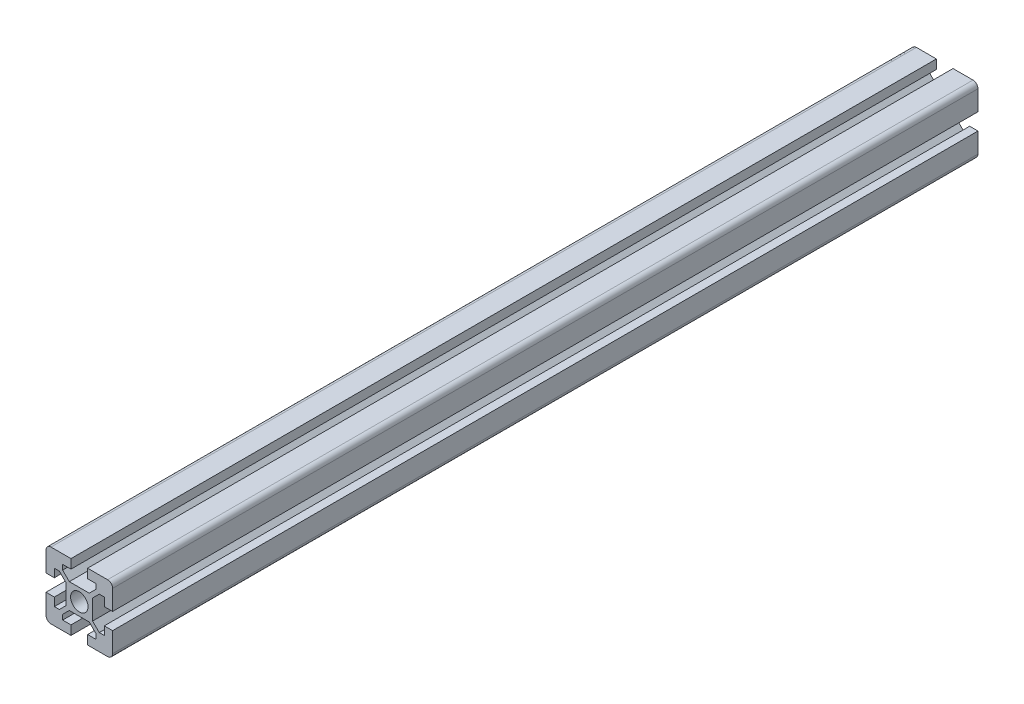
ISO-10303-21;
HEADER;
FILE_DESCRIPTION(('STEP AP214'),'2;1');
FILE_NAME('part.step','',(''),(''),'','','');
FILE_SCHEMA(('AUTOMOTIVE_DESIGN { 1 0 10303 214 1 1 1 1 }'));
ENDSEC;
DATA;
#1=APPLICATION_CONTEXT('core data for automotive mechanical design processes');
#2=APPLICATION_PROTOCOL_DEFINITION('international standard','automotive_design',2000,#1);
#3=PRODUCT_CONTEXT('',#1,'mechanical');
#4=PRODUCT('Part','Part','',(#3));
#5=PRODUCT_RELATED_PRODUCT_CATEGORY('part','',(#4));
#6=PRODUCT_DEFINITION_FORMATION('','',#4);
#7=PRODUCT_DEFINITION_CONTEXT('part definition',#1,'design');
#8=PRODUCT_DEFINITION('design','',#6,#7);
#9=PRODUCT_DEFINITION_SHAPE('','',#8);
#10=(LENGTH_UNIT() NAMED_UNIT(*) SI_UNIT(.MILLI.,.METRE.));
#11=(NAMED_UNIT(*) PLANE_ANGLE_UNIT() SI_UNIT($,.RADIAN.));
#12=(NAMED_UNIT(*) SI_UNIT($,.STERADIAN.) SOLID_ANGLE_UNIT());
#13=UNCERTAINTY_MEASURE_WITH_UNIT(LENGTH_MEASURE(1.E-05),#10,'distance_accuracy_value','');
#14=(GEOMETRIC_REPRESENTATION_CONTEXT(3) GLOBAL_UNCERTAINTY_ASSIGNED_CONTEXT((#13)) GLOBAL_UNIT_ASSIGNED_CONTEXT((#10,
#11,#12)) REPRESENTATION_CONTEXT('',''));
#15=CARTESIAN_POINT('',(0.,0.,0.));
#16=DIRECTION('',(0.,0.,1.));
#17=DIRECTION('',(1.,0.,0.));
#18=AXIS2_PLACEMENT_3D('',#15,#16,#17);
#19=CARTESIAN_POINT('',(20.,0.,520.));
#20=DIRECTION('',(0.,1.,0.));
#21=DIRECTION('',(0.,0.,1.));
#22=AXIS2_PLACEMENT_3D('',#19,#20,#21);
#23=PLANE('',#22);
#24=DIRECTION('',(1.,0.,0.));
#25=VECTOR('',#24,1.);
#26=CARTESIAN_POINT('',(20.,0.,0.));
#27=LINE('',#26,#25);
#28=CARTESIAN_POINT('',(3.00000000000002,0.,0.));
#29=VERTEX_POINT('',#28);
#30=CARTESIAN_POINT('',(15.,0.,0.));
#31=VERTEX_POINT('',#30);
#32=EDGE_CURVE('E371',#29,#31,#27,.T.);
#33=ORIENTED_EDGE('',*,*,#32,.F.);
#34=DIRECTION('',(0.,0.,-1.));
#35=VECTOR('',#34,1.);
#36=CARTESIAN_POINT('',(3.00000000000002,0.,520.));
#37=LINE('',#36,#35);
#38=CARTESIAN_POINT('',(3.00000000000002,0.,520.));
#39=VERTEX_POINT('',#38);
#40=EDGE_CURVE('E11',#39,#29,#37,.T.);
#41=ORIENTED_EDGE('',*,*,#40,.F.);
#42=DIRECTION('',(1.,0.,0.));
#43=VECTOR('',#42,1.);
#44=CARTESIAN_POINT('',(20.,0.,520.));
#45=LINE('',#44,#43);
#46=CARTESIAN_POINT('',(15.,0.,520.));
#47=VERTEX_POINT('',#46);
#48=EDGE_CURVE('E823',#39,#47,#45,.T.);
#49=ORIENTED_EDGE('',*,*,#48,.T.);
#50=DIRECTION('',(0.,0.,-1.));
#51=VECTOR('',#50,1.);
#52=CARTESIAN_POINT('',(15.,0.,520.));
#53=LINE('',#52,#51);
#54=EDGE_CURVE('E50',#47,#31,#53,.T.);
#55=ORIENTED_EDGE('',*,*,#54,.T.);
#56=EDGE_LOOP('',(#33,#41,#49,#55));
#57=FACE_BOUND('',#56,.T.);
#58=ADVANCED_FACE('F33',(#57),#23,.T.);
#59=CARTESIAN_POINT('',(3.,-3.,520.));
#60=DIRECTION('',(0.,0.,-1.));
#61=DIRECTION('',(-1.,0.,0.));
#62=AXIS2_PLACEMENT_3D('',#59,#60,#61);
#63=CYLINDRICAL_SURFACE('',#62,3.);
#64=CARTESIAN_POINT('',(3.,-3.,0.));
#65=DIRECTION('',(0.,0.,1.));
#66=DIRECTION('',(1.,0.,0.));
#67=AXIS2_PLACEMENT_3D('',#64,#65,#66);
#68=CIRCLE('',#67,3.);
#69=CARTESIAN_POINT('',(0.,-3.00000000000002,0.));
#70=VERTEX_POINT('',#69);
#71=EDGE_CURVE('E373',#29,#70,#68,.T.);
#72=ORIENTED_EDGE('',*,*,#71,.T.);
#73=DIRECTION('',(0.,0.,-1.));
#74=VECTOR('',#73,1.);
#75=CARTESIAN_POINT('',(0.,-3.00000000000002,520.));
#76=LINE('',#75,#74);
#77=CARTESIAN_POINT('',(0.,-3.00000000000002,520.));
#78=VERTEX_POINT('',#77);
#79=EDGE_CURVE('E42',#78,#70,#76,.T.);
#80=ORIENTED_EDGE('',*,*,#79,.F.);
#81=CARTESIAN_POINT('',(3.,-3.,520.));
#82=DIRECTION('',(0.,0.,1.));
#83=DIRECTION('',(1.,0.,0.));
#84=AXIS2_PLACEMENT_3D('',#81,#82,#83);
#85=CIRCLE('',#84,3.);
#86=EDGE_CURVE('E825',#39,#78,#85,.T.);
#87=ORIENTED_EDGE('',*,*,#86,.F.);
#88=ORIENTED_EDGE('',*,*,#40,.T.);
#89=EDGE_LOOP('',(#72,#80,#87,#88));
#90=FACE_BOUND('',#89,.T.);
#91=ADVANCED_FACE('F627',(#90),#63,.T.);
#92=CARTESIAN_POINT('',(0.,-64.1414213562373,520.));
#93=DIRECTION('',(1.,0.,0.));
#94=DIRECTION('',(0.,1.,0.));
#95=AXIS2_PLACEMENT_3D('',#92,#93,#94);
#96=PLANE('',#95);
#97=DIRECTION('',(0.,-1.,0.));
#98=VECTOR('',#97,1.);
#99=CARTESIAN_POINT('',(0.,-64.1414213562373,0.));
#100=LINE('',#99,#98);
#101=CARTESIAN_POINT('',(0.,-15.,0.));
#102=VERTEX_POINT('',#101);
#103=EDGE_CURVE('E376',#70,#102,#100,.T.);
#104=ORIENTED_EDGE('',*,*,#103,.T.);
#105=DIRECTION('',(0.,0.,-1.));
#106=VECTOR('',#105,1.);
#107=CARTESIAN_POINT('',(0.,-15.,520.));
#108=LINE('',#107,#106);
#109=CARTESIAN_POINT('',(0.,-15.,520.));
#110=VERTEX_POINT('',#109);
#111=EDGE_CURVE('E615',#110,#102,#108,.T.);
#112=ORIENTED_EDGE('',*,*,#111,.F.);
#113=DIRECTION('',(0.,-1.,0.));
#114=VECTOR('',#113,1.);
#115=CARTESIAN_POINT('',(0.,-64.1414213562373,520.));
#116=LINE('',#115,#114);
#117=EDGE_CURVE('E623',#78,#110,#116,.T.);
#118=ORIENTED_EDGE('',*,*,#117,.F.);
#119=ORIENTED_EDGE('',*,*,#79,.T.);
#120=EDGE_LOOP('',(#104,#112,#118,#119));
#121=FACE_BOUND('',#120,.T.);
#122=ADVANCED_FACE('F620',(#121),#96,.F.);
#123=CARTESIAN_POINT('',(20.,-15.,520.));
#124=DIRECTION('',(0.,1.,0.));
#125=DIRECTION('',(0.,0.,1.));
#126=AXIS2_PLACEMENT_3D('',#123,#124,#125);
#127=PLANE('',#126);
#128=DIRECTION('',(1.,0.,0.));
#129=VECTOR('',#128,1.);
#130=CARTESIAN_POINT('',(20.,-15.,0.));
#131=LINE('',#130,#129);
#132=CARTESIAN_POINT('',(4.99999999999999,-15.,0.));
#133=VERTEX_POINT('',#132);
#134=EDGE_CURVE('E379',#102,#133,#131,.T.);
#135=ORIENTED_EDGE('',*,*,#134,.T.);
#136=DIRECTION('',(0.,0.,-1.));
#137=VECTOR('',#136,1.);
#138=CARTESIAN_POINT('',(4.99999999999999,-15.,520.));
#139=LINE('',#138,#137);
#140=CARTESIAN_POINT('',(4.99999999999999,-15.,520.));
#141=VERTEX_POINT('',#140);
#142=EDGE_CURVE('E612',#141,#133,#139,.T.);
#143=ORIENTED_EDGE('',*,*,#142,.F.);
#144=DIRECTION('',(1.,0.,0.));
#145=VECTOR('',#144,1.);
#146=CARTESIAN_POINT('',(20.,-15.,520.));
#147=LINE('',#146,#145);
#148=EDGE_CURVE('E830',#110,#141,#147,.T.);
#149=ORIENTED_EDGE('',*,*,#148,.F.);
#150=ORIENTED_EDGE('',*,*,#111,.T.);
#151=EDGE_LOOP('',(#135,#143,#149,#150));
#152=FACE_BOUND('',#151,.T.);
#153=ADVANCED_FACE('F638',(#152),#127,.F.);
#154=CARTESIAN_POINT('',(5.,-64.1414213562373,520.));
#155=DIRECTION('',(-1.,0.,0.));
#156=DIRECTION('',(0.,-1.,0.));
#157=AXIS2_PLACEMENT_3D('',#154,#155,#156);
#158=PLANE('',#157);
#159=DIRECTION('',(0.,1.,0.));
#160=VECTOR('',#159,1.);
#161=CARTESIAN_POINT('',(5.,-64.1414213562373,0.));
#162=LINE('',#161,#160);
#163=CARTESIAN_POINT('',(4.99999999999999,-10.,0.));
#164=VERTEX_POINT('',#163);
#165=EDGE_CURVE('E382',#133,#164,#162,.T.);
#166=ORIENTED_EDGE('',*,*,#165,.T.);
#167=DIRECTION('',(0.,0.,-1.));
#168=VECTOR('',#167,1.);
#169=CARTESIAN_POINT('',(4.99999999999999,-10.,520.));
#170=LINE('',#169,#168);
#171=CARTESIAN_POINT('',(4.99999999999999,-10.,520.));
#172=VERTEX_POINT('',#171);
#173=EDGE_CURVE('E609',#172,#164,#170,.T.);
#174=ORIENTED_EDGE('',*,*,#173,.F.);
#175=DIRECTION('',(0.,1.,0.));
#176=VECTOR('',#175,1.);
#177=CARTESIAN_POINT('',(5.,-64.1414213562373,520.));
#178=LINE('',#177,#176);
#179=EDGE_CURVE('E833',#141,#172,#178,.T.);
#180=ORIENTED_EDGE('',*,*,#179,.F.);
#181=ORIENTED_EDGE('',*,*,#142,.T.);
#182=EDGE_LOOP('',(#166,#174,#180,#181));
#183=FACE_BOUND('',#182,.T.);
#184=ADVANCED_FACE('F641',(#183),#158,.F.);
#185=CARTESIAN_POINT('',(20.,-10.,520.));
#186=DIRECTION('',(0.,1.,0.));
#187=DIRECTION('',(0.,0.,1.));
#188=AXIS2_PLACEMENT_3D('',#185,#186,#187);
#189=PLANE('',#188);
#190=DIRECTION('',(1.,0.,0.));
#191=VECTOR('',#190,1.);
#192=CARTESIAN_POINT('',(20.,-10.,0.));
#193=LINE('',#192,#191);
#194=CARTESIAN_POINT('',(7.99999999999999,-10.,0.));
#195=VERTEX_POINT('',#194);
#196=EDGE_CURVE('E385',#164,#195,#193,.T.);
#197=ORIENTED_EDGE('',*,*,#196,.T.);
#198=DIRECTION('',(0.,0.,-1.));
#199=VECTOR('',#198,1.);
#200=CARTESIAN_POINT('',(7.99999999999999,-10.,520.));
#201=LINE('',#200,#199);
#202=CARTESIAN_POINT('',(7.99999999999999,-10.,520.));
#203=VERTEX_POINT('',#202);
#204=EDGE_CURVE('E606',#203,#195,#201,.T.);
#205=ORIENTED_EDGE('',*,*,#204,.F.);
#206=DIRECTION('',(1.,0.,0.));
#207=VECTOR('',#206,1.);
#208=CARTESIAN_POINT('',(20.,-10.,520.));
#209=LINE('',#208,#207);
#210=EDGE_CURVE('E836',#172,#203,#209,.T.);
#211=ORIENTED_EDGE('',*,*,#210,.F.);
#212=ORIENTED_EDGE('',*,*,#173,.T.);
#213=EDGE_LOOP('',(#197,#205,#211,#212));
#214=FACE_BOUND('',#213,.T.);
#215=ADVANCED_FACE('F645',(#214),#189,.F.);
#216=CARTESIAN_POINT('',(41.0707106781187,-43.0707106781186,520.));
#217=DIRECTION('',(0.707106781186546,0.707106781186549,0.));
#218=DIRECTION('',(-0.707106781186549,0.707106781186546,0.));
#219=AXIS2_PLACEMENT_3D('',#216,#217,#218);
#220=PLANE('',#219);
#221=DIRECTION('',(0.707106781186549,-0.707106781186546,0.));
#222=VECTOR('',#221,1.);
#223=CARTESIAN_POINT('',(41.0707106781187,-43.0707106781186,0.));
#224=LINE('',#223,#222);
#225=CARTESIAN_POINT('',(12.,-14.,0.));
#226=VERTEX_POINT('',#225);
#227=EDGE_CURVE('E388',#195,#226,#224,.T.);
#228=ORIENTED_EDGE('',*,*,#227,.T.);
#229=DIRECTION('',(0.,0.,-1.));
#230=VECTOR('',#229,1.);
#231=CARTESIAN_POINT('',(12.,-14.,520.));
#232=LINE('',#231,#230);
#233=CARTESIAN_POINT('',(12.,-14.,520.));
#234=VERTEX_POINT('',#233);
#235=EDGE_CURVE('E603',#234,#226,#232,.T.);
#236=ORIENTED_EDGE('',*,*,#235,.F.);
#237=DIRECTION('',(0.707106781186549,-0.707106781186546,0.));
#238=VECTOR('',#237,1.);
#239=CARTESIAN_POINT('',(41.0707106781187,-43.0707106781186,520.));
#240=LINE('',#239,#238);
#241=EDGE_CURVE('E839',#203,#234,#240,.T.);
#242=ORIENTED_EDGE('',*,*,#241,.F.);
#243=ORIENTED_EDGE('',*,*,#204,.T.);
#244=EDGE_LOOP('',(#228,#236,#242,#243));
#245=FACE_BOUND('',#244,.T.);
#246=ADVANCED_FACE('F649',(#245),#220,.F.);
#247=CARTESIAN_POINT('',(12.,-64.1414213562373,520.));
#248=DIRECTION('',(1.,0.,0.));
#249=DIRECTION('',(0.,1.,0.));
#250=AXIS2_PLACEMENT_3D('',#247,#248,#249);
#251=PLANE('',#250);
#252=DIRECTION('',(0.,-1.,0.));
#253=VECTOR('',#252,1.);
#254=CARTESIAN_POINT('',(12.,-64.1414213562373,0.));
#255=LINE('',#254,#253);
#256=CARTESIAN_POINT('',(12.,-26.,0.));
#257=VERTEX_POINT('',#256);
#258=EDGE_CURVE('E391',#226,#257,#255,.T.);
#259=ORIENTED_EDGE('',*,*,#258,.T.);
#260=DIRECTION('',(0.,0.,-1.));
#261=VECTOR('',#260,1.);
#262=CARTESIAN_POINT('',(12.,-26.,520.));
#263=LINE('',#262,#261);
#264=CARTESIAN_POINT('',(12.,-26.,520.));
#265=VERTEX_POINT('',#264);
#266=EDGE_CURVE('E600',#265,#257,#263,.T.);
#267=ORIENTED_EDGE('',*,*,#266,.F.);
#268=DIRECTION('',(0.,-1.,0.));
#269=VECTOR('',#268,1.);
#270=CARTESIAN_POINT('',(12.,-64.1414213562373,520.));
#271=LINE('',#270,#269);
#272=EDGE_CURVE('E842',#234,#265,#271,.T.);
#273=ORIENTED_EDGE('',*,*,#272,.F.);
#274=ORIENTED_EDGE('',*,*,#235,.T.);
#275=EDGE_LOOP('',(#259,#267,#273,#274));
#276=FACE_BOUND('',#275,.T.);
#277=ADVANCED_FACE('F653',(#276),#251,.F.);
#278=CARTESIAN_POINT('',(-3.07071067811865,-41.0707106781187,520.));
#279=DIRECTION('',(0.707106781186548,-0.707106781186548,0.));
#280=DIRECTION('',(0.707106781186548,0.707106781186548,0.));
#281=AXIS2_PLACEMENT_3D('',#278,#279,#280);
#282=PLANE('',#281);
#283=DIRECTION('',(-0.707106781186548,-0.707106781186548,0.));
#284=VECTOR('',#283,1.);
#285=CARTESIAN_POINT('',(-3.07071067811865,-41.0707106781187,0.));
#286=LINE('',#285,#284);
#287=CARTESIAN_POINT('',(8.00000000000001,-30.,0.));
#288=VERTEX_POINT('',#287);
#289=EDGE_CURVE('E394',#257,#288,#286,.T.);
#290=ORIENTED_EDGE('',*,*,#289,.T.);
#291=DIRECTION('',(0.,0.,-1.));
#292=VECTOR('',#291,1.);
#293=CARTESIAN_POINT('',(8.00000000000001,-30.,520.));
#294=LINE('',#293,#292);
#295=CARTESIAN_POINT('',(8.00000000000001,-30.,520.));
#296=VERTEX_POINT('',#295);
#297=EDGE_CURVE('E597',#296,#288,#294,.T.);
#298=ORIENTED_EDGE('',*,*,#297,.F.);
#299=DIRECTION('',(-0.707106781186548,-0.707106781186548,0.));
#300=VECTOR('',#299,1.);
#301=CARTESIAN_POINT('',(-3.07071067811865,-41.0707106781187,520.));
#302=LINE('',#301,#300);
#303=EDGE_CURVE('E845',#265,#296,#302,.T.);
#304=ORIENTED_EDGE('',*,*,#303,.F.);
#305=ORIENTED_EDGE('',*,*,#266,.T.);
#306=EDGE_LOOP('',(#290,#298,#304,#305));
#307=FACE_BOUND('',#306,.T.);
#308=ADVANCED_FACE('F657',(#307),#282,.F.);
#309=CARTESIAN_POINT('',(20.,-30.,520.));
#310=DIRECTION('',(0.,-1.,0.));
#311=DIRECTION('',(0.,0.,-1.));
#312=AXIS2_PLACEMENT_3D('',#309,#310,#311);
#313=PLANE('',#312);
#314=DIRECTION('',(-1.,0.,0.));
#315=VECTOR('',#314,1.);
#316=CARTESIAN_POINT('',(20.,-30.,0.));
#317=LINE('',#316,#315);
#318=CARTESIAN_POINT('',(5.,-30.,0.));
#319=VERTEX_POINT('',#318);
#320=EDGE_CURVE('E397',#288,#319,#317,.T.);
#321=ORIENTED_EDGE('',*,*,#320,.T.);
#322=DIRECTION('',(0.,0.,-1.));
#323=VECTOR('',#322,1.);
#324=CARTESIAN_POINT('',(5.,-30.,520.));
#325=LINE('',#324,#323);
#326=CARTESIAN_POINT('',(5.,-30.,520.));
#327=VERTEX_POINT('',#326);
#328=EDGE_CURVE('E594',#327,#319,#325,.T.);
#329=ORIENTED_EDGE('',*,*,#328,.F.);
#330=DIRECTION('',(-1.,0.,0.));
#331=VECTOR('',#330,1.);
#332=CARTESIAN_POINT('',(20.,-30.,520.));
#333=LINE('',#332,#331);
#334=EDGE_CURVE('E848',#296,#327,#333,.T.);
#335=ORIENTED_EDGE('',*,*,#334,.F.);
#336=ORIENTED_EDGE('',*,*,#297,.T.);
#337=EDGE_LOOP('',(#321,#329,#335,#336));
#338=FACE_BOUND('',#337,.T.);
#339=ADVANCED_FACE('F661',(#338),#313,.F.);
#340=CARTESIAN_POINT('',(5.,-64.1414213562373,520.));
#341=DIRECTION('',(-1.,0.,0.));
#342=DIRECTION('',(0.,0.,1.));
#343=AXIS2_PLACEMENT_3D('',#340,#341,#342);
#344=PLANE('',#343);
#345=DIRECTION('',(0.,1.,0.));
#346=VECTOR('',#345,1.);
#347=CARTESIAN_POINT('',(5.,-64.1414213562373,0.));
#348=LINE('',#347,#346);
#349=CARTESIAN_POINT('',(5.,-25.,0.));
#350=VERTEX_POINT('',#349);
#351=EDGE_CURVE('E400',#319,#350,#348,.T.);
#352=ORIENTED_EDGE('',*,*,#351,.T.);
#353=DIRECTION('',(0.,0.,-1.));
#354=VECTOR('',#353,1.);
#355=CARTESIAN_POINT('',(5.,-25.,520.));
#356=LINE('',#355,#354);
#357=CARTESIAN_POINT('',(5.,-25.,520.));
#358=VERTEX_POINT('',#357);
#359=EDGE_CURVE('E592',#358,#350,#356,.T.);
#360=ORIENTED_EDGE('',*,*,#359,.F.);
#361=DIRECTION('',(0.,1.,0.));
#362=VECTOR('',#361,1.);
#363=CARTESIAN_POINT('',(5.,-64.1414213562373,520.));
#364=LINE('',#363,#362);
#365=EDGE_CURVE('E851',#327,#358,#364,.T.);
#366=ORIENTED_EDGE('',*,*,#365,.F.);
#367=ORIENTED_EDGE('',*,*,#328,.T.);
#368=EDGE_LOOP('',(#352,#360,#366,#367));
#369=FACE_BOUND('',#368,.T.);
#370=ADVANCED_FACE('F665',(#369),#344,.F.);
#371=CARTESIAN_POINT('',(20.,-25.,520.));
#372=DIRECTION('',(0.,1.,0.));
#373=DIRECTION('',(0.,0.,1.));
#374=AXIS2_PLACEMENT_3D('',#371,#372,#373);
#375=PLANE('',#374);
#376=DIRECTION('',(1.,0.,0.));
#377=VECTOR('',#376,1.);
#378=CARTESIAN_POINT('',(20.,-25.,0.));
#379=LINE('',#378,#377);
#380=CARTESIAN_POINT('',(0.,-25.,0.));
#381=VERTEX_POINT('',#380);
#382=EDGE_CURVE('E403',#381,#350,#379,.T.);
#383=ORIENTED_EDGE('',*,*,#382,.F.);
#384=DIRECTION('',(0.,0.,-1.));
#385=VECTOR('',#384,1.);
#386=CARTESIAN_POINT('',(0.,-25.,520.));
#387=LINE('',#386,#385);
#388=CARTESIAN_POINT('',(0.,-25.,520.));
#389=VERTEX_POINT('',#388);
#390=EDGE_CURVE('E590',#389,#381,#387,.T.);
#391=ORIENTED_EDGE('',*,*,#390,.F.);
#392=DIRECTION('',(1.,0.,0.));
#393=VECTOR('',#392,1.);
#394=CARTESIAN_POINT('',(20.,-25.,520.));
#395=LINE('',#394,#393);
#396=EDGE_CURVE('E853',#389,#358,#395,.T.);
#397=ORIENTED_EDGE('',*,*,#396,.T.);
#398=ORIENTED_EDGE('',*,*,#359,.T.);
#399=EDGE_LOOP('',(#383,#391,#397,#398));
#400=FACE_BOUND('',#399,.T.);
#401=ADVANCED_FACE('F669',(#400),#375,.T.);
#402=CARTESIAN_POINT('',(0.,-64.1414213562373,520.));
#403=DIRECTION('',(1.,0.,0.));
#404=DIRECTION('',(0.,1.,0.));
#405=AXIS2_PLACEMENT_3D('',#402,#403,#404);
#406=PLANE('',#405);
#407=DIRECTION('',(0.,-1.,0.));
#408=VECTOR('',#407,1.);
#409=CARTESIAN_POINT('',(0.,-64.1414213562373,0.));
#410=LINE('',#409,#408);
#411=CARTESIAN_POINT('',(0.,-37.,0.));
#412=VERTEX_POINT('',#411);
#413=EDGE_CURVE('E406',#381,#412,#410,.T.);
#414=ORIENTED_EDGE('',*,*,#413,.T.);
#415=DIRECTION('',(0.,0.,-1.));
#416=VECTOR('',#415,1.);
#417=CARTESIAN_POINT('',(0.,-37.,520.));
#418=LINE('',#417,#416);
#419=CARTESIAN_POINT('',(0.,-37.,520.));
#420=VERTEX_POINT('',#419);
#421=EDGE_CURVE('E587',#420,#412,#418,.T.);
#422=ORIENTED_EDGE('',*,*,#421,.F.);
#423=DIRECTION('',(0.,-1.,0.));
#424=VECTOR('',#423,1.);
#425=CARTESIAN_POINT('',(0.,-64.1414213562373,520.));
#426=LINE('',#425,#424);
#427=EDGE_CURVE('E856',#389,#420,#426,.T.);
#428=ORIENTED_EDGE('',*,*,#427,.F.);
#429=ORIENTED_EDGE('',*,*,#390,.T.);
#430=EDGE_LOOP('',(#414,#422,#428,#429));
#431=FACE_BOUND('',#430,.T.);
#432=ADVANCED_FACE('F673',(#431),#406,.F.);
#433=CARTESIAN_POINT('',(3.,-37.,520.));
#434=DIRECTION('',(0.,0.,-1.));
#435=DIRECTION('',(-1.,0.,0.));
#436=AXIS2_PLACEMENT_3D('',#433,#434,#435);
#437=CYLINDRICAL_SURFACE('',#436,3.);
#438=CARTESIAN_POINT('',(3.,-37.,0.));
#439=DIRECTION('',(0.,0.,1.));
#440=DIRECTION('',(1.,0.,0.));
#441=AXIS2_PLACEMENT_3D('',#438,#439,#440);
#442=CIRCLE('',#441,3.);
#443=CARTESIAN_POINT('',(3.00000000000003,-40.,0.));
#444=VERTEX_POINT('',#443);
#445=EDGE_CURVE('E409',#412,#444,#442,.T.);
#446=ORIENTED_EDGE('',*,*,#445,.T.);
#447=DIRECTION('',(0.,0.,-1.));
#448=VECTOR('',#447,1.);
#449=CARTESIAN_POINT('',(3.00000000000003,-40.,520.));
#450=LINE('',#449,#448);
#451=CARTESIAN_POINT('',(3.00000000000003,-40.,520.));
#452=VERTEX_POINT('',#451);
#453=EDGE_CURVE('E584',#452,#444,#450,.T.);
#454=ORIENTED_EDGE('',*,*,#453,.F.);
#455=CARTESIAN_POINT('',(3.,-37.,520.));
#456=DIRECTION('',(0.,0.,1.));
#457=DIRECTION('',(1.,0.,0.));
#458=AXIS2_PLACEMENT_3D('',#455,#456,#457);
#459=CIRCLE('',#458,3.);
#460=EDGE_CURVE('E859',#420,#452,#459,.T.);
#461=ORIENTED_EDGE('',*,*,#460,.F.);
#462=ORIENTED_EDGE('',*,*,#421,.T.);
#463=EDGE_LOOP('',(#446,#454,#461,#462));
#464=FACE_BOUND('',#463,.T.);
#465=ADVANCED_FACE('F677',(#464),#437,.T.);
#466=CARTESIAN_POINT('',(20.,-40.,520.));
#467=DIRECTION('',(0.,1.,0.));
#468=DIRECTION('',(0.,0.,1.));
#469=AXIS2_PLACEMENT_3D('',#466,#467,#468);
#470=PLANE('',#469);
#471=DIRECTION('',(1.,0.,0.));
#472=VECTOR('',#471,1.);
#473=CARTESIAN_POINT('',(20.,-40.,0.));
#474=LINE('',#473,#472);
#475=CARTESIAN_POINT('',(15.,-40.,0.));
#476=VERTEX_POINT('',#475);
#477=EDGE_CURVE('E412',#444,#476,#474,.T.);
#478=ORIENTED_EDGE('',*,*,#477,.T.);
#479=DIRECTION('',(0.,0.,-1.));
#480=VECTOR('',#479,1.);
#481=CARTESIAN_POINT('',(15.,-40.,520.));
#482=LINE('',#481,#480);
#483=CARTESIAN_POINT('',(15.,-40.,520.));
#484=VERTEX_POINT('',#483);
#485=EDGE_CURVE('E581',#484,#476,#482,.T.);
#486=ORIENTED_EDGE('',*,*,#485,.F.);
#487=DIRECTION('',(1.,0.,0.));
#488=VECTOR('',#487,1.);
#489=CARTESIAN_POINT('',(20.,-40.,520.));
#490=LINE('',#489,#488);
#491=EDGE_CURVE('E862',#452,#484,#490,.T.);
#492=ORIENTED_EDGE('',*,*,#491,.F.);
#493=ORIENTED_EDGE('',*,*,#453,.T.);
#494=EDGE_LOOP('',(#478,#486,#492,#493));
#495=FACE_BOUND('',#494,.T.);
#496=ADVANCED_FACE('F681',(#495),#470,.F.);
#497=CARTESIAN_POINT('',(15.,-64.1414213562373,520.));
#498=DIRECTION('',(-1.,0.,0.));
#499=DIRECTION('',(0.,-1.,0.));
#500=AXIS2_PLACEMENT_3D('',#497,#498,#499);
#501=PLANE('',#500);
#502=DIRECTION('',(0.,1.,0.));
#503=VECTOR('',#502,1.);
#504=CARTESIAN_POINT('',(15.,-64.1414213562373,0.));
#505=LINE('',#504,#503);
#506=CARTESIAN_POINT('',(15.,-34.5,0.));
#507=VERTEX_POINT('',#506);
#508=EDGE_CURVE('E415',#476,#507,#505,.T.);
#509=ORIENTED_EDGE('',*,*,#508,.T.);
#510=DIRECTION('',(0.,0.,-1.));
#511=VECTOR('',#510,1.);
#512=CARTESIAN_POINT('',(15.,-34.5,520.));
#513=LINE('',#512,#511);
#514=CARTESIAN_POINT('',(15.,-34.5,520.));
#515=VERTEX_POINT('',#514);
#516=EDGE_CURVE('E578',#515,#507,#513,.T.);
#517=ORIENTED_EDGE('',*,*,#516,.F.);
#518=DIRECTION('',(0.,1.,0.));
#519=VECTOR('',#518,1.);
#520=CARTESIAN_POINT('',(15.,-64.1414213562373,520.));
#521=LINE('',#520,#519);
#522=EDGE_CURVE('E865',#484,#515,#521,.T.);
#523=ORIENTED_EDGE('',*,*,#522,.F.);
#524=ORIENTED_EDGE('',*,*,#485,.T.);
#525=EDGE_LOOP('',(#509,#517,#523,#524));
#526=FACE_BOUND('',#525,.T.);
#527=ADVANCED_FACE('F685',(#526),#501,.F.);
#528=CARTESIAN_POINT('',(20.,-34.5,520.));
#529=DIRECTION('',(0.,-1.,0.));
#530=DIRECTION('',(0.,0.,-1.));
#531=AXIS2_PLACEMENT_3D('',#528,#529,#530);
#532=PLANE('',#531);
#533=DIRECTION('',(-1.,0.,0.));
#534=VECTOR('',#533,1.);
#535=CARTESIAN_POINT('',(20.,-34.5,0.));
#536=LINE('',#535,#534);
#537=CARTESIAN_POINT('',(10.,-34.5,0.));
#538=VERTEX_POINT('',#537);
#539=EDGE_CURVE('E418',#507,#538,#536,.T.);
#540=ORIENTED_EDGE('',*,*,#539,.T.);
#541=DIRECTION('',(0.,0.,-1.));
#542=VECTOR('',#541,1.);
#543=CARTESIAN_POINT('',(10.,-34.5,520.));
#544=LINE('',#543,#542);
#545=CARTESIAN_POINT('',(10.,-34.5,520.));
#546=VERTEX_POINT('',#545);
#547=EDGE_CURVE('E575',#546,#538,#544,.T.);
#548=ORIENTED_EDGE('',*,*,#547,.F.);
#549=DIRECTION('',(-1.,0.,0.));
#550=VECTOR('',#549,1.);
#551=CARTESIAN_POINT('',(20.,-34.5,520.));
#552=LINE('',#551,#550);
#553=EDGE_CURVE('E868',#515,#546,#552,.T.);
#554=ORIENTED_EDGE('',*,*,#553,.F.);
#555=ORIENTED_EDGE('',*,*,#516,.T.);
#556=EDGE_LOOP('',(#540,#548,#554,#555));
#557=FACE_BOUND('',#556,.T.);
#558=ADVANCED_FACE('F689',(#557),#532,.F.);
#559=CARTESIAN_POINT('',(10.,-64.1414213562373,520.));
#560=DIRECTION('',(-1.,0.,0.));
#561=DIRECTION('',(0.,0.,1.));
#562=AXIS2_PLACEMENT_3D('',#559,#560,#561);
#563=PLANE('',#562);
#564=DIRECTION('',(0.,1.,0.));
#565=VECTOR('',#564,1.);
#566=CARTESIAN_POINT('',(10.,-64.1414213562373,0.));
#567=LINE('',#566,#565);
#568=CARTESIAN_POINT('',(10.,-31.5,0.));
#569=VERTEX_POINT('',#568);
#570=EDGE_CURVE('E421',#538,#569,#567,.T.);
#571=ORIENTED_EDGE('',*,*,#570,.T.);
#572=DIRECTION('',(0.,0.,-1.));
#573=VECTOR('',#572,1.);
#574=CARTESIAN_POINT('',(10.,-31.5,520.));
#575=LINE('',#574,#573);
#576=CARTESIAN_POINT('',(10.,-31.5,520.));
#577=VERTEX_POINT('',#576);
#578=EDGE_CURVE('E572',#577,#569,#575,.T.);
#579=ORIENTED_EDGE('',*,*,#578,.F.);
#580=DIRECTION('',(0.,1.,0.));
#581=VECTOR('',#580,1.);
#582=CARTESIAN_POINT('',(10.,-64.1414213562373,520.));
#583=LINE('',#582,#581);
#584=EDGE_CURVE('E871',#546,#577,#583,.T.);
#585=ORIENTED_EDGE('',*,*,#584,.F.);
#586=ORIENTED_EDGE('',*,*,#547,.T.);
#587=EDGE_LOOP('',(#571,#579,#585,#586));
#588=FACE_BOUND('',#587,.T.);
#589=ADVANCED_FACE('F693',(#588),#563,.F.);
#590=CARTESIAN_POINT('',(-1.32071067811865,-42.8207106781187,520.));
#591=DIRECTION('',(-0.707106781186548,0.707106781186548,0.));
#592=DIRECTION('',(-0.707106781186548,-0.707106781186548,0.));
#593=AXIS2_PLACEMENT_3D('',#590,#591,#592);
#594=PLANE('',#593);
#595=DIRECTION('',(0.707106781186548,0.707106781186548,0.));
#596=VECTOR('',#595,1.);
#597=CARTESIAN_POINT('',(-1.32071067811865,-42.8207106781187,0.));
#598=LINE('',#597,#596);
#599=CARTESIAN_POINT('',(14.,-27.5,0.));
#600=VERTEX_POINT('',#599);
#601=EDGE_CURVE('E424',#569,#600,#598,.T.);
#602=ORIENTED_EDGE('',*,*,#601,.T.);
#603=DIRECTION('',(0.,0.,-1.));
#604=VECTOR('',#603,1.);
#605=CARTESIAN_POINT('',(14.,-27.5,520.));
#606=LINE('',#605,#604);
#607=CARTESIAN_POINT('',(14.,-27.5,520.));
#608=VERTEX_POINT('',#607);
#609=EDGE_CURVE('E569',#608,#600,#606,.T.);
#610=ORIENTED_EDGE('',*,*,#609,.F.);
#611=DIRECTION('',(0.707106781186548,0.707106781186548,0.));
#612=VECTOR('',#611,1.);
#613=CARTESIAN_POINT('',(-1.32071067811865,-42.8207106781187,520.));
#614=LINE('',#613,#612);
#615=EDGE_CURVE('E874',#577,#608,#614,.T.);
#616=ORIENTED_EDGE('',*,*,#615,.F.);
#617=ORIENTED_EDGE('',*,*,#578,.T.);
#618=EDGE_LOOP('',(#602,#610,#616,#617));
#619=FACE_BOUND('',#618,.T.);
#620=ADVANCED_FACE('F697',(#619),#594,.F.);
#621=CARTESIAN_POINT('',(20.,-27.5,520.));
#622=DIRECTION('',(0.,1.,0.));
#623=DIRECTION('',(0.,0.,1.));
#624=AXIS2_PLACEMENT_3D('',#621,#622,#623);
#625=PLANE('',#624);
#626=DIRECTION('',(1.,0.,0.));
#627=VECTOR('',#626,1.);
#628=CARTESIAN_POINT('',(20.,-27.5,0.));
#629=LINE('',#628,#627);
#630=CARTESIAN_POINT('',(26.,-27.5,0.));
#631=VERTEX_POINT('',#630);
#632=EDGE_CURVE('E427',#600,#631,#629,.T.);
#633=ORIENTED_EDGE('',*,*,#632,.T.);
#634=DIRECTION('',(0.,0.,-1.));
#635=VECTOR('',#634,1.);
#636=CARTESIAN_POINT('',(26.,-27.5,520.));
#637=LINE('',#636,#635);
#638=CARTESIAN_POINT('',(26.,-27.5,520.));
#639=VERTEX_POINT('',#638);
#640=EDGE_CURVE('E566',#639,#631,#637,.T.);
#641=ORIENTED_EDGE('',*,*,#640,.F.);
#642=DIRECTION('',(1.,0.,0.));
#643=VECTOR('',#642,1.);
#644=CARTESIAN_POINT('',(20.,-27.5,520.));
#645=LINE('',#644,#643);
#646=EDGE_CURVE('E877',#608,#639,#645,.T.);
#647=ORIENTED_EDGE('',*,*,#646,.F.);
#648=ORIENTED_EDGE('',*,*,#609,.T.);
#649=EDGE_LOOP('',(#633,#641,#647,#648));
#650=FACE_BOUND('',#649,.T.);
#651=ADVANCED_FACE('F701',(#650),#625,.F.);
#652=CARTESIAN_POINT('',(41.3207106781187,-42.8207106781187,520.));
#653=DIRECTION('',(0.707106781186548,0.707106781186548,0.));
#654=DIRECTION('',(-0.707106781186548,0.707106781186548,0.));
#655=AXIS2_PLACEMENT_3D('',#652,#653,#654);
#656=PLANE('',#655);
#657=DIRECTION('',(0.707106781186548,-0.707106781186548,0.));
#658=VECTOR('',#657,1.);
#659=CARTESIAN_POINT('',(41.3207106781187,-42.8207106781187,0.));
#660=LINE('',#659,#658);
#661=CARTESIAN_POINT('',(30.,-31.5,0.));
#662=VERTEX_POINT('',#661);
#663=EDGE_CURVE('E430',#631,#662,#660,.T.);
#664=ORIENTED_EDGE('',*,*,#663,.T.);
#665=DIRECTION('',(0.,0.,-1.));
#666=VECTOR('',#665,1.);
#667=CARTESIAN_POINT('',(30.,-31.5,520.));
#668=LINE('',#667,#666);
#669=CARTESIAN_POINT('',(30.,-31.5,520.));
#670=VERTEX_POINT('',#669);
#671=EDGE_CURVE('E563',#670,#662,#668,.T.);
#672=ORIENTED_EDGE('',*,*,#671,.F.);
#673=DIRECTION('',(0.707106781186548,-0.707106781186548,0.));
#674=VECTOR('',#673,1.);
#675=CARTESIAN_POINT('',(41.3207106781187,-42.8207106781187,520.));
#676=LINE('',#675,#674);
#677=EDGE_CURVE('E880',#639,#670,#676,.T.);
#678=ORIENTED_EDGE('',*,*,#677,.F.);
#679=ORIENTED_EDGE('',*,*,#640,.T.);
#680=EDGE_LOOP('',(#664,#672,#678,#679));
#681=FACE_BOUND('',#680,.T.);
#682=ADVANCED_FACE('F705',(#681),#656,.F.);
#683=CARTESIAN_POINT('',(30.,-64.1414213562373,520.));
#684=DIRECTION('',(1.,0.,0.));
#685=DIRECTION('',(0.,0.,-1.));
#686=AXIS2_PLACEMENT_3D('',#683,#684,#685);
#687=PLANE('',#686);
#688=DIRECTION('',(0.,-1.,0.));
#689=VECTOR('',#688,1.);
#690=CARTESIAN_POINT('',(30.,-64.1414213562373,0.));
#691=LINE('',#690,#689);
#692=CARTESIAN_POINT('',(30.,-34.5,0.));
#693=VERTEX_POINT('',#692);
#694=EDGE_CURVE('E433',#662,#693,#691,.T.);
#695=ORIENTED_EDGE('',*,*,#694,.T.);
#696=DIRECTION('',(0.,0.,-1.));
#697=VECTOR('',#696,1.);
#698=CARTESIAN_POINT('',(30.,-34.5,520.));
#699=LINE('',#698,#697);
#700=CARTESIAN_POINT('',(30.,-34.5,520.));
#701=VERTEX_POINT('',#700);
#702=EDGE_CURVE('E560',#701,#693,#699,.T.);
#703=ORIENTED_EDGE('',*,*,#702,.F.);
#704=DIRECTION('',(0.,-1.,0.));
#705=VECTOR('',#704,1.);
#706=CARTESIAN_POINT('',(30.,-64.1414213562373,520.));
#707=LINE('',#706,#705);
#708=EDGE_CURVE('E883',#670,#701,#707,.T.);
#709=ORIENTED_EDGE('',*,*,#708,.F.);
#710=ORIENTED_EDGE('',*,*,#671,.T.);
#711=EDGE_LOOP('',(#695,#703,#709,#710));
#712=FACE_BOUND('',#711,.T.);
#713=ADVANCED_FACE('F709',(#712),#687,.F.);
#714=CARTESIAN_POINT('',(20.,-34.5,520.));
#715=DIRECTION('',(0.,-1.,0.));
#716=DIRECTION('',(1.,0.,0.));
#717=AXIS2_PLACEMENT_3D('',#714,#715,#716);
#718=PLANE('',#717);
#719=DIRECTION('',(-1.,0.,0.));
#720=VECTOR('',#719,1.);
#721=CARTESIAN_POINT('',(20.,-34.5,0.));
#722=LINE('',#721,#720);
#723=CARTESIAN_POINT('',(25.,-34.5,0.));
#724=VERTEX_POINT('',#723);
#725=EDGE_CURVE('E436',#693,#724,#722,.T.);
#726=ORIENTED_EDGE('',*,*,#725,.T.);
#727=DIRECTION('',(0.,0.,-1.));
#728=VECTOR('',#727,1.);
#729=CARTESIAN_POINT('',(25.,-34.5,520.));
#730=LINE('',#729,#728);
#731=CARTESIAN_POINT('',(25.,-34.5,520.));
#732=VERTEX_POINT('',#731);
#733=EDGE_CURVE('E558',#732,#724,#730,.T.);
#734=ORIENTED_EDGE('',*,*,#733,.F.);
#735=DIRECTION('',(-1.,0.,0.));
#736=VECTOR('',#735,1.);
#737=CARTESIAN_POINT('',(20.,-34.5,520.));
#738=LINE('',#737,#736);
#739=EDGE_CURVE('E886',#701,#732,#738,.T.);
#740=ORIENTED_EDGE('',*,*,#739,.F.);
#741=ORIENTED_EDGE('',*,*,#702,.T.);
#742=EDGE_LOOP('',(#726,#734,#740,#741));
#743=FACE_BOUND('',#742,.T.);
#744=ADVANCED_FACE('F713',(#743),#718,.F.);
#745=CARTESIAN_POINT('',(25.,-64.1414213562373,520.));
#746=DIRECTION('',(-1.,0.,0.));
#747=DIRECTION('',(0.,0.,1.));
#748=AXIS2_PLACEMENT_3D('',#745,#746,#747);
#749=PLANE('',#748);
#750=DIRECTION('',(0.,1.,0.));
#751=VECTOR('',#750,1.);
#752=CARTESIAN_POINT('',(25.,-64.1414213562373,0.));
#753=LINE('',#752,#751);
#754=CARTESIAN_POINT('',(25.,-40.,0.));
#755=VERTEX_POINT('',#754);
#756=EDGE_CURVE('E439',#755,#724,#753,.T.);
#757=ORIENTED_EDGE('',*,*,#756,.F.);
#758=DIRECTION('',(0.,0.,-1.));
#759=VECTOR('',#758,1.);
#760=CARTESIAN_POINT('',(25.,-40.,520.));
#761=LINE('',#760,#759);
#762=CARTESIAN_POINT('',(25.,-40.,520.));
#763=VERTEX_POINT('',#762);
#764=EDGE_CURVE('E556',#763,#755,#761,.T.);
#765=ORIENTED_EDGE('',*,*,#764,.F.);
#766=DIRECTION('',(0.,1.,0.));
#767=VECTOR('',#766,1.);
#768=CARTESIAN_POINT('',(25.,-64.1414213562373,520.));
#769=LINE('',#768,#767);
#770=EDGE_CURVE('E888',#763,#732,#769,.T.);
#771=ORIENTED_EDGE('',*,*,#770,.T.);
#772=ORIENTED_EDGE('',*,*,#733,.T.);
#773=EDGE_LOOP('',(#757,#765,#771,#772));
#774=FACE_BOUND('',#773,.T.);
#775=ADVANCED_FACE('F717',(#774),#749,.T.);
#776=CARTESIAN_POINT('',(20.,-40.,520.));
#777=DIRECTION('',(0.,1.,0.));
#778=DIRECTION('',(0.,0.,1.));
#779=AXIS2_PLACEMENT_3D('',#776,#777,#778);
#780=PLANE('',#779);
#781=DIRECTION('',(1.,0.,0.));
#782=VECTOR('',#781,1.);
#783=CARTESIAN_POINT('',(20.,-40.,0.));
#784=LINE('',#783,#782);
#785=CARTESIAN_POINT('',(37.,-40.,0.));
#786=VERTEX_POINT('',#785);
#787=EDGE_CURVE('E442',#755,#786,#784,.T.);
#788=ORIENTED_EDGE('',*,*,#787,.T.);
#789=DIRECTION('',(0.,0.,-1.));
#790=VECTOR('',#789,1.);
#791=CARTESIAN_POINT('',(37.,-40.,520.));
#792=LINE('',#791,#790);
#793=CARTESIAN_POINT('',(37.,-40.,520.));
#794=VERTEX_POINT('',#793);
#795=EDGE_CURVE('E553',#794,#786,#792,.T.);
#796=ORIENTED_EDGE('',*,*,#795,.F.);
#797=DIRECTION('',(1.,0.,0.));
#798=VECTOR('',#797,1.);
#799=CARTESIAN_POINT('',(20.,-40.,520.));
#800=LINE('',#799,#798);
#801=EDGE_CURVE('E891',#763,#794,#800,.T.);
#802=ORIENTED_EDGE('',*,*,#801,.F.);
#803=ORIENTED_EDGE('',*,*,#764,.T.);
#804=EDGE_LOOP('',(#788,#796,#802,#803));
#805=FACE_BOUND('',#804,.T.);
#806=ADVANCED_FACE('F721',(#805),#780,.F.);
#807=CARTESIAN_POINT('',(37.,-37.,520.));
#808=DIRECTION('',(0.,0.,-1.));
#809=DIRECTION('',(-1.,0.,0.));
#810=AXIS2_PLACEMENT_3D('',#807,#808,#809);
#811=CYLINDRICAL_SURFACE('',#810,3.);
#812=CARTESIAN_POINT('',(37.,-37.,0.));
#813=DIRECTION('',(0.,0.,1.));
#814=DIRECTION('',(1.,0.,0.));
#815=AXIS2_PLACEMENT_3D('',#812,#813,#814);
#816=CIRCLE('',#815,3.);
#817=CARTESIAN_POINT('',(40.,-37.,0.));
#818=VERTEX_POINT('',#817);
#819=EDGE_CURVE('E445',#786,#818,#816,.T.);
#820=ORIENTED_EDGE('',*,*,#819,.T.);
#821=DIRECTION('',(0.,0.,-1.));
#822=VECTOR('',#821,1.);
#823=CARTESIAN_POINT('',(40.,-37.,520.));
#824=LINE('',#823,#822);
#825=CARTESIAN_POINT('',(40.,-37.,520.));
#826=VERTEX_POINT('',#825);
#827=EDGE_CURVE('E551',#826,#818,#824,.T.);
#828=ORIENTED_EDGE('',*,*,#827,.F.);
#829=CARTESIAN_POINT('',(37.,-37.,520.));
#830=DIRECTION('',(0.,0.,1.));
#831=DIRECTION('',(1.,0.,0.));
#832=AXIS2_PLACEMENT_3D('',#829,#830,#831);
#833=CIRCLE('',#832,3.);
#834=EDGE_CURVE('E894',#794,#826,#833,.T.);
#835=ORIENTED_EDGE('',*,*,#834,.F.);
#836=ORIENTED_EDGE('',*,*,#795,.T.);
#837=EDGE_LOOP('',(#820,#828,#835,#836));
#838=FACE_BOUND('',#837,.T.);
#839=ADVANCED_FACE('F725',(#838),#811,.T.);
#840=CARTESIAN_POINT('',(40.,-64.1414213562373,520.));
#841=DIRECTION('',(1.,0.,0.));
#842=DIRECTION('',(0.,1.,0.));
#843=AXIS2_PLACEMENT_3D('',#840,#841,#842);
#844=PLANE('',#843);
#845=DIRECTION('',(0.,-1.,0.));
#846=VECTOR('',#845,1.);
#847=CARTESIAN_POINT('',(40.,-64.1414213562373,0.));
#848=LINE('',#847,#846);
#849=CARTESIAN_POINT('',(40.,-25.,0.));
#850=VERTEX_POINT('',#849);
#851=EDGE_CURVE('E448',#850,#818,#848,.T.);
#852=ORIENTED_EDGE('',*,*,#851,.F.);
#853=DIRECTION('',(0.,0.,-1.));
#854=VECTOR('',#853,1.);
#855=CARTESIAN_POINT('',(40.,-25.,520.));
#856=LINE('',#855,#854);
#857=CARTESIAN_POINT('',(40.,-25.,520.));
#858=VERTEX_POINT('',#857);
#859=EDGE_CURVE('E549',#858,#850,#856,.T.);
#860=ORIENTED_EDGE('',*,*,#859,.F.);
#861=DIRECTION('',(0.,-1.,0.));
#862=VECTOR('',#861,1.);
#863=CARTESIAN_POINT('',(40.,-64.1414213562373,520.));
#864=LINE('',#863,#862);
#865=EDGE_CURVE('E896',#858,#826,#864,.T.);
#866=ORIENTED_EDGE('',*,*,#865,.T.);
#867=ORIENTED_EDGE('',*,*,#827,.T.);
#868=EDGE_LOOP('',(#852,#860,#866,#867));
#869=FACE_BOUND('',#868,.T.);
#870=ADVANCED_FACE('F729',(#869),#844,.T.);
#871=CARTESIAN_POINT('',(20.,-25.,520.));
#872=DIRECTION('',(0.,-1.,0.));
#873=DIRECTION('',(0.,0.,-1.));
#874=AXIS2_PLACEMENT_3D('',#871,#872,#873);
#875=PLANE('',#874);
#876=DIRECTION('',(-1.,0.,0.));
#877=VECTOR('',#876,1.);
#878=CARTESIAN_POINT('',(20.,-25.,0.));
#879=LINE('',#878,#877);
#880=CARTESIAN_POINT('',(35.,-25.,0.));
#881=VERTEX_POINT('',#880);
#882=EDGE_CURVE('E451',#850,#881,#879,.T.);
#883=ORIENTED_EDGE('',*,*,#882,.T.);
#884=DIRECTION('',(0.,0.,-1.));
#885=VECTOR('',#884,1.);
#886=CARTESIAN_POINT('',(35.,-25.,520.));
#887=LINE('',#886,#885);
#888=CARTESIAN_POINT('',(35.,-25.,520.));
#889=VERTEX_POINT('',#888);
#890=EDGE_CURVE('E547',#889,#881,#887,.T.);
#891=ORIENTED_EDGE('',*,*,#890,.F.);
#892=DIRECTION('',(-1.,0.,0.));
#893=VECTOR('',#892,1.);
#894=CARTESIAN_POINT('',(20.,-25.,520.));
#895=LINE('',#894,#893);
#896=EDGE_CURVE('E899',#858,#889,#895,.T.);
#897=ORIENTED_EDGE('',*,*,#896,.F.);
#898=ORIENTED_EDGE('',*,*,#859,.T.);
#899=EDGE_LOOP('',(#883,#891,#897,#898));
#900=FACE_BOUND('',#899,.T.);
#901=ADVANCED_FACE('F733',(#900),#875,.F.);
#902=CARTESIAN_POINT('',(35.,-64.1414213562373,520.));
#903=DIRECTION('',(-1.,0.,0.));
#904=DIRECTION('',(0.,0.,1.));
#905=AXIS2_PLACEMENT_3D('',#902,#903,#904);
#906=PLANE('',#905);
#907=DIRECTION('',(0.,1.,0.));
#908=VECTOR('',#907,1.);
#909=CARTESIAN_POINT('',(35.,-64.1414213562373,0.));
#910=LINE('',#909,#908);
#911=CARTESIAN_POINT('',(35.,-30.,0.));
#912=VERTEX_POINT('',#911);
#913=EDGE_CURVE('E454',#912,#881,#910,.T.);
#914=ORIENTED_EDGE('',*,*,#913,.F.);
#915=DIRECTION('',(0.,0.,-1.));
#916=VECTOR('',#915,1.);
#917=CARTESIAN_POINT('',(35.,-30.,520.));
#918=LINE('',#917,#916);
#919=CARTESIAN_POINT('',(35.,-30.,520.));
#920=VERTEX_POINT('',#919);
#921=EDGE_CURVE('E545',#920,#912,#918,.T.);
#922=ORIENTED_EDGE('',*,*,#921,.F.);
#923=DIRECTION('',(0.,1.,0.));
#924=VECTOR('',#923,1.);
#925=CARTESIAN_POINT('',(35.,-64.1414213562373,520.));
#926=LINE('',#925,#924);
#927=EDGE_CURVE('E901',#920,#889,#926,.T.);
#928=ORIENTED_EDGE('',*,*,#927,.T.);
#929=ORIENTED_EDGE('',*,*,#890,.T.);
#930=EDGE_LOOP('',(#914,#922,#928,#929));
#931=FACE_BOUND('',#930,.T.);
#932=ADVANCED_FACE('F737',(#931),#906,.T.);
#933=CARTESIAN_POINT('',(20.,-30.,520.));
#934=DIRECTION('',(0.,1.,0.));
#935=DIRECTION('',(0.,0.,1.));
#936=AXIS2_PLACEMENT_3D('',#933,#934,#935);
#937=PLANE('',#936);
#938=DIRECTION('',(1.,0.,0.));
#939=VECTOR('',#938,1.);
#940=CARTESIAN_POINT('',(20.,-30.,0.));
#941=LINE('',#940,#939);
#942=CARTESIAN_POINT('',(32.,-30.,0.));
#943=VERTEX_POINT('',#942);
#944=EDGE_CURVE('E457',#943,#912,#941,.T.);
#945=ORIENTED_EDGE('',*,*,#944,.F.);
#946=DIRECTION('',(0.,0.,-1.));
#947=VECTOR('',#946,1.);
#948=CARTESIAN_POINT('',(32.,-30.,520.));
#949=LINE('',#948,#947);
#950=CARTESIAN_POINT('',(32.,-30.,520.));
#951=VERTEX_POINT('',#950);
#952=EDGE_CURVE('E543',#951,#943,#949,.T.);
#953=ORIENTED_EDGE('',*,*,#952,.F.);
#954=DIRECTION('',(1.,0.,0.));
#955=VECTOR('',#954,1.);
#956=CARTESIAN_POINT('',(20.,-30.,520.));
#957=LINE('',#956,#955);
#958=EDGE_CURVE('E904',#951,#920,#957,.T.);
#959=ORIENTED_EDGE('',*,*,#958,.T.);
#960=ORIENTED_EDGE('',*,*,#921,.T.);
#961=EDGE_LOOP('',(#945,#953,#959,#960));
#962=FACE_BOUND('',#961,.T.);
#963=ADVANCED_FACE('F741',(#962),#937,.T.);
#964=CARTESIAN_POINT('',(43.0707106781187,-41.0707106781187,520.));
#965=DIRECTION('',(0.707106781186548,0.707106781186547,0.));
#966=DIRECTION('',(-0.707106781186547,0.707106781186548,0.));
#967=AXIS2_PLACEMENT_3D('',#964,#965,#966);
#968=PLANE('',#967);
#969=DIRECTION('',(0.707106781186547,-0.707106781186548,0.));
#970=VECTOR('',#969,1.);
#971=CARTESIAN_POINT('',(43.0707106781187,-41.0707106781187,0.));
#972=LINE('',#971,#970);
#973=CARTESIAN_POINT('',(28.,-26.,0.));
#974=VERTEX_POINT('',#973);
#975=EDGE_CURVE('E460',#974,#943,#972,.T.);
#976=ORIENTED_EDGE('',*,*,#975,.F.);
#977=DIRECTION('',(0.,0.,-1.));
#978=VECTOR('',#977,1.);
#979=CARTESIAN_POINT('',(28.,-26.,520.));
#980=LINE('',#979,#978);
#981=CARTESIAN_POINT('',(28.,-26.,520.));
#982=VERTEX_POINT('',#981);
#983=EDGE_CURVE('E541',#982,#974,#980,.T.);
#984=ORIENTED_EDGE('',*,*,#983,.F.);
#985=DIRECTION('',(0.707106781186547,-0.707106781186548,0.));
#986=VECTOR('',#985,1.);
#987=CARTESIAN_POINT('',(43.0707106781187,-41.0707106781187,520.));
#988=LINE('',#987,#986);
#989=EDGE_CURVE('E907',#982,#951,#988,.T.);
#990=ORIENTED_EDGE('',*,*,#989,.T.);
#991=ORIENTED_EDGE('',*,*,#952,.T.);
#992=EDGE_LOOP('',(#976,#984,#990,#991));
#993=FACE_BOUND('',#992,.T.);
#994=ADVANCED_FACE('F745',(#993),#968,.T.);
#995=CARTESIAN_POINT('',(28.,-64.1414213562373,520.));
#996=DIRECTION('',(1.,0.,0.));
#997=DIRECTION('',(0.,1.,0.));
#998=AXIS2_PLACEMENT_3D('',#995,#996,#997);
#999=PLANE('',#998);
#1000=DIRECTION('',(0.,-1.,0.));
#1001=VECTOR('',#1000,1.);
#1002=CARTESIAN_POINT('',(28.,-64.1414213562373,0.));
#1003=LINE('',#1002,#1001);
#1004=CARTESIAN_POINT('',(28.,-14.,0.));
#1005=VERTEX_POINT('',#1004);
#1006=EDGE_CURVE('E463',#1005,#974,#1003,.T.);
#1007=ORIENTED_EDGE('',*,*,#1006,.F.);
#1008=DIRECTION('',(0.,0.,-1.));
#1009=VECTOR('',#1008,1.);
#1010=CARTESIAN_POINT('',(28.,-14.,520.));
#1011=LINE('',#1010,#1009);
#1012=CARTESIAN_POINT('',(28.,-14.,520.));
#1013=VERTEX_POINT('',#1012);
#1014=EDGE_CURVE('E539',#1013,#1005,#1011,.T.);
#1015=ORIENTED_EDGE('',*,*,#1014,.F.);
#1016=DIRECTION('',(0.,-1.,0.));
#1017=VECTOR('',#1016,1.);
#1018=CARTESIAN_POINT('',(28.,-64.1414213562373,520.));
#1019=LINE('',#1018,#1017);
#1020=EDGE_CURVE('E910',#1013,#982,#1019,.T.);
#1021=ORIENTED_EDGE('',*,*,#1020,.T.);
#1022=ORIENTED_EDGE('',*,*,#983,.T.);
#1023=EDGE_LOOP('',(#1007,#1015,#1021,#1022));
#1024=FACE_BOUND('',#1023,.T.);
#1025=ADVANCED_FACE('F749',(#1024),#999,.T.);
#1026=CARTESIAN_POINT('',(-1.07071067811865,-43.0707106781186,520.));
#1027=DIRECTION('',(0.707106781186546,-0.707106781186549,0.));
#1028=DIRECTION('',(0.707106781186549,0.707106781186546,0.));
#1029=AXIS2_PLACEMENT_3D('',#1026,#1027,#1028);
#1030=PLANE('',#1029);
#1031=DIRECTION('',(-0.707106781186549,-0.707106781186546,0.));
#1032=VECTOR('',#1031,1.);
#1033=CARTESIAN_POINT('',(-1.07071067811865,-43.0707106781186,0.));
#1034=LINE('',#1033,#1032);
#1035=CARTESIAN_POINT('',(32.,-10.,0.));
#1036=VERTEX_POINT('',#1035);
#1037=EDGE_CURVE('E466',#1036,#1005,#1034,.T.);
#1038=ORIENTED_EDGE('',*,*,#1037,.F.);
#1039=DIRECTION('',(0.,0.,-1.));
#1040=VECTOR('',#1039,1.);
#1041=CARTESIAN_POINT('',(32.,-10.,520.));
#1042=LINE('',#1041,#1040);
#1043=CARTESIAN_POINT('',(32.,-10.,520.));
#1044=VERTEX_POINT('',#1043);
#1045=EDGE_CURVE('E537',#1044,#1036,#1042,.T.);
#1046=ORIENTED_EDGE('',*,*,#1045,.F.);
#1047=DIRECTION('',(-0.707106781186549,-0.707106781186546,0.));
#1048=VECTOR('',#1047,1.);
#1049=CARTESIAN_POINT('',(-1.07071067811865,-43.0707106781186,520.));
#1050=LINE('',#1049,#1048);
#1051=EDGE_CURVE('E913',#1044,#1013,#1050,.T.);
#1052=ORIENTED_EDGE('',*,*,#1051,.T.);
#1053=ORIENTED_EDGE('',*,*,#1014,.T.);
#1054=EDGE_LOOP('',(#1038,#1046,#1052,#1053));
#1055=FACE_BOUND('',#1054,.T.);
#1056=ADVANCED_FACE('F753',(#1055),#1030,.T.);
#1057=CARTESIAN_POINT('',(20.,-10.,520.));
#1058=DIRECTION('',(0.,-1.,0.));
#1059=DIRECTION('',(0.,0.,-1.));
#1060=AXIS2_PLACEMENT_3D('',#1057,#1058,#1059);
#1061=PLANE('',#1060);
#1062=DIRECTION('',(-1.,0.,0.));
#1063=VECTOR('',#1062,1.);
#1064=CARTESIAN_POINT('',(20.,-10.,0.));
#1065=LINE('',#1064,#1063);
#1066=CARTESIAN_POINT('',(35.,-10.,0.));
#1067=VERTEX_POINT('',#1066);
#1068=EDGE_CURVE('E469',#1067,#1036,#1065,.T.);
#1069=ORIENTED_EDGE('',*,*,#1068,.F.);
#1070=DIRECTION('',(0.,0.,-1.));
#1071=VECTOR('',#1070,1.);
#1072=CARTESIAN_POINT('',(35.,-10.,520.));
#1073=LINE('',#1072,#1071);
#1074=CARTESIAN_POINT('',(35.,-10.,520.));
#1075=VERTEX_POINT('',#1074);
#1076=EDGE_CURVE('E535',#1075,#1067,#1073,.T.);
#1077=ORIENTED_EDGE('',*,*,#1076,.F.);
#1078=DIRECTION('',(-1.,0.,0.));
#1079=VECTOR('',#1078,1.);
#1080=CARTESIAN_POINT('',(20.,-10.,520.));
#1081=LINE('',#1080,#1079);
#1082=EDGE_CURVE('E916',#1075,#1044,#1081,.T.);
#1083=ORIENTED_EDGE('',*,*,#1082,.T.);
#1084=ORIENTED_EDGE('',*,*,#1045,.T.);
#1085=EDGE_LOOP('',(#1069,#1077,#1083,#1084));
#1086=FACE_BOUND('',#1085,.T.);
#1087=ADVANCED_FACE('F757',(#1086),#1061,.T.);
#1088=CARTESIAN_POINT('',(35.0000000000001,-64.1414213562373,520.));
#1089=DIRECTION('',(-1.,0.,0.));
#1090=DIRECTION('',(0.,-1.,0.));
#1091=AXIS2_PLACEMENT_3D('',#1088,#1089,#1090);
#1092=PLANE('',#1091);
#1093=DIRECTION('',(0.,1.,0.));
#1094=VECTOR('',#1093,1.);
#1095=CARTESIAN_POINT('',(35.0000000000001,-64.1414213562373,0.));
#1096=LINE('',#1095,#1094);
#1097=CARTESIAN_POINT('',(35.,-15.,0.));
#1098=VERTEX_POINT('',#1097);
#1099=EDGE_CURVE('E472',#1098,#1067,#1096,.T.);
#1100=ORIENTED_EDGE('',*,*,#1099,.F.);
#1101=DIRECTION('',(0.,0.,-1.));
#1102=VECTOR('',#1101,1.);
#1103=CARTESIAN_POINT('',(35.,-15.,520.));
#1104=LINE('',#1103,#1102);
#1105=CARTESIAN_POINT('',(35.,-15.,520.));
#1106=VERTEX_POINT('',#1105);
#1107=EDGE_CURVE('E533',#1106,#1098,#1104,.T.);
#1108=ORIENTED_EDGE('',*,*,#1107,.F.);
#1109=DIRECTION('',(0.,1.,0.));
#1110=VECTOR('',#1109,1.);
#1111=CARTESIAN_POINT('',(35.0000000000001,-64.1414213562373,520.));
#1112=LINE('',#1111,#1110);
#1113=EDGE_CURVE('E919',#1106,#1075,#1112,.T.);
#1114=ORIENTED_EDGE('',*,*,#1113,.T.);
#1115=ORIENTED_EDGE('',*,*,#1076,.T.);
#1116=EDGE_LOOP('',(#1100,#1108,#1114,#1115));
#1117=FACE_BOUND('',#1116,.T.);
#1118=ADVANCED_FACE('F761',(#1117),#1092,.T.);
#1119=CARTESIAN_POINT('',(20.,-15.,520.));
#1120=DIRECTION('',(0.,-1.,0.));
#1121=DIRECTION('',(0.,0.,-1.));
#1122=AXIS2_PLACEMENT_3D('',#1119,#1120,#1121);
#1123=PLANE('',#1122);
#1124=DIRECTION('',(-1.,0.,0.));
#1125=VECTOR('',#1124,1.);
#1126=CARTESIAN_POINT('',(20.,-15.,0.));
#1127=LINE('',#1126,#1125);
#1128=CARTESIAN_POINT('',(40.,-15.,0.));
#1129=VERTEX_POINT('',#1128);
#1130=EDGE_CURVE('E475',#1129,#1098,#1127,.T.);
#1131=ORIENTED_EDGE('',*,*,#1130,.F.);
#1132=DIRECTION('',(0.,0.,-1.));
#1133=VECTOR('',#1132,1.);
#1134=CARTESIAN_POINT('',(40.,-15.,520.));
#1135=LINE('',#1134,#1133);
#1136=CARTESIAN_POINT('',(40.,-15.,520.));
#1137=VERTEX_POINT('',#1136);
#1138=EDGE_CURVE('E531',#1137,#1129,#1135,.T.);
#1139=ORIENTED_EDGE('',*,*,#1138,.F.);
#1140=DIRECTION('',(-1.,0.,0.));
#1141=VECTOR('',#1140,1.);
#1142=CARTESIAN_POINT('',(20.,-15.,520.));
#1143=LINE('',#1142,#1141);
#1144=EDGE_CURVE('E922',#1137,#1106,#1143,.T.);
#1145=ORIENTED_EDGE('',*,*,#1144,.T.);
#1146=ORIENTED_EDGE('',*,*,#1107,.T.);
#1147=EDGE_LOOP('',(#1131,#1139,#1145,#1146));
#1148=FACE_BOUND('',#1147,.T.);
#1149=ADVANCED_FACE('F765',(#1148),#1123,.T.);
#1150=CARTESIAN_POINT('',(40.,-64.1414213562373,520.));
#1151=DIRECTION('',(1.,0.,0.));
#1152=DIRECTION('',(0.,0.,-1.));
#1153=AXIS2_PLACEMENT_3D('',#1150,#1151,#1152);
#1154=PLANE('',#1153);
#1155=DIRECTION('',(0.,-1.,0.));
#1156=VECTOR('',#1155,1.);
#1157=CARTESIAN_POINT('',(40.,-64.1414213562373,0.));
#1158=LINE('',#1157,#1156);
#1159=CARTESIAN_POINT('',(40.,-3.00000000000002,0.));
#1160=VERTEX_POINT('',#1159);
#1161=EDGE_CURVE('E478',#1160,#1129,#1158,.T.);
#1162=ORIENTED_EDGE('',*,*,#1161,.F.);
#1163=DIRECTION('',(0.,0.,-1.));
#1164=VECTOR('',#1163,1.);
#1165=CARTESIAN_POINT('',(40.,-3.00000000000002,520.));
#1166=LINE('',#1165,#1164);
#1167=CARTESIAN_POINT('',(40.,-3.00000000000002,520.));
#1168=VERTEX_POINT('',#1167);
#1169=EDGE_CURVE('E529',#1168,#1160,#1166,.T.);
#1170=ORIENTED_EDGE('',*,*,#1169,.F.);
#1171=DIRECTION('',(0.,-1.,0.));
#1172=VECTOR('',#1171,1.);
#1173=CARTESIAN_POINT('',(40.,-64.1414213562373,520.));
#1174=LINE('',#1173,#1172);
#1175=EDGE_CURVE('E925',#1168,#1137,#1174,.T.);
#1176=ORIENTED_EDGE('',*,*,#1175,.T.);
#1177=ORIENTED_EDGE('',*,*,#1138,.T.);
#1178=EDGE_LOOP('',(#1162,#1170,#1176,#1177));
#1179=FACE_BOUND('',#1178,.T.);
#1180=ADVANCED_FACE('F769',(#1179),#1154,.T.);
#1181=CARTESIAN_POINT('',(37.,-3.,520.));
#1182=DIRECTION('',(0.,0.,-1.));
#1183=DIRECTION('',(-1.,0.,0.));
#1184=AXIS2_PLACEMENT_3D('',#1181,#1182,#1183);
#1185=CYLINDRICAL_SURFACE('',#1184,3.);
#1186=CARTESIAN_POINT('',(37.,-3.,0.));
#1187=DIRECTION('',(0.,0.,1.));
#1188=DIRECTION('',(1.,0.,0.));
#1189=AXIS2_PLACEMENT_3D('',#1186,#1187,#1188);
#1190=CIRCLE('',#1189,3.);
#1191=CARTESIAN_POINT('',(37.,0.,0.));
#1192=VERTEX_POINT('',#1191);
#1193=EDGE_CURVE('E481',#1192,#1160,#1190,.F.);
#1194=ORIENTED_EDGE('',*,*,#1193,.F.);
#1195=DIRECTION('',(0.,0.,-1.));
#1196=VECTOR('',#1195,1.);
#1197=CARTESIAN_POINT('',(37.,0.,520.));
#1198=LINE('',#1197,#1196);
#1199=CARTESIAN_POINT('',(37.,0.,520.));
#1200=VERTEX_POINT('',#1199);
#1201=EDGE_CURVE('E527',#1200,#1192,#1198,.T.);
#1202=ORIENTED_EDGE('',*,*,#1201,.F.);
#1203=CARTESIAN_POINT('',(37.,-3.,520.));
#1204=DIRECTION('',(0.,0.,1.));
#1205=DIRECTION('',(1.,0.,0.));
#1206=AXIS2_PLACEMENT_3D('',#1203,#1204,#1205);
#1207=CIRCLE('',#1206,3.);
#1208=EDGE_CURVE('E928',#1200,#1168,#1207,.F.);
#1209=ORIENTED_EDGE('',*,*,#1208,.T.);
#1210=ORIENTED_EDGE('',*,*,#1169,.T.);
#1211=EDGE_LOOP('',(#1194,#1202,#1209,#1210));
#1212=FACE_BOUND('',#1211,.T.);
#1213=ADVANCED_FACE('F773',(#1212),#1185,.T.);
#1214=CARTESIAN_POINT('',(20.,0.,520.));
#1215=DIRECTION('',(0.,1.,0.));
#1216=DIRECTION('',(0.,0.,1.));
#1217=AXIS2_PLACEMENT_3D('',#1214,#1215,#1216);
#1218=PLANE('',#1217);
#1219=DIRECTION('',(1.,0.,0.));
#1220=VECTOR('',#1219,1.);
#1221=CARTESIAN_POINT('',(20.,0.,0.));
#1222=LINE('',#1221,#1220);
#1223=CARTESIAN_POINT('',(25.,0.,0.));
#1224=VERTEX_POINT('',#1223);
#1225=EDGE_CURVE('E484',#1224,#1192,#1222,.T.);
#1226=ORIENTED_EDGE('',*,*,#1225,.F.);
#1227=DIRECTION('',(0.,0.,-1.));
#1228=VECTOR('',#1227,1.);
#1229=CARTESIAN_POINT('',(25.,0.,520.));
#1230=LINE('',#1229,#1228);
#1231=CARTESIAN_POINT('',(25.,0.,520.));
#1232=VERTEX_POINT('',#1231);
#1233=EDGE_CURVE('E525',#1232,#1224,#1230,.T.);
#1234=ORIENTED_EDGE('',*,*,#1233,.F.);
#1235=DIRECTION('',(1.,0.,0.));
#1236=VECTOR('',#1235,1.);
#1237=CARTESIAN_POINT('',(20.,0.,520.));
#1238=LINE('',#1237,#1236);
#1239=EDGE_CURVE('E931',#1232,#1200,#1238,.T.);
#1240=ORIENTED_EDGE('',*,*,#1239,.T.);
#1241=ORIENTED_EDGE('',*,*,#1201,.T.);
#1242=EDGE_LOOP('',(#1226,#1234,#1240,#1241));
#1243=FACE_BOUND('',#1242,.T.);
#1244=ADVANCED_FACE('F777',(#1243),#1218,.T.);
#1245=CARTESIAN_POINT('',(25.,-64.1414213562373,520.));
#1246=DIRECTION('',(1.,0.,0.));
#1247=DIRECTION('',(0.,0.,-1.));
#1248=AXIS2_PLACEMENT_3D('',#1245,#1246,#1247);
#1249=PLANE('',#1248);
#1250=DIRECTION('',(0.,-1.,0.));
#1251=VECTOR('',#1250,1.);
#1252=CARTESIAN_POINT('',(25.,-64.1414213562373,0.));
#1253=LINE('',#1252,#1251);
#1254=CARTESIAN_POINT('',(25.,-5.5,0.));
#1255=VERTEX_POINT('',#1254);
#1256=EDGE_CURVE('E487',#1224,#1255,#1253,.T.);
#1257=ORIENTED_EDGE('',*,*,#1256,.T.);
#1258=DIRECTION('',(0.,0.,-1.));
#1259=VECTOR('',#1258,1.);
#1260=CARTESIAN_POINT('',(25.,-5.5,520.));
#1261=LINE('',#1260,#1259);
#1262=CARTESIAN_POINT('',(25.,-5.5,520.));
#1263=VERTEX_POINT('',#1262);
#1264=EDGE_CURVE('E523',#1263,#1255,#1261,.T.);
#1265=ORIENTED_EDGE('',*,*,#1264,.F.);
#1266=DIRECTION('',(0.,-1.,0.));
#1267=VECTOR('',#1266,1.);
#1268=CARTESIAN_POINT('',(25.,-64.1414213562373,520.));
#1269=LINE('',#1268,#1267);
#1270=EDGE_CURVE('E934',#1232,#1263,#1269,.T.);
#1271=ORIENTED_EDGE('',*,*,#1270,.F.);
#1272=ORIENTED_EDGE('',*,*,#1233,.T.);
#1273=EDGE_LOOP('',(#1257,#1265,#1271,#1272));
#1274=FACE_BOUND('',#1273,.T.);
#1275=ADVANCED_FACE('F781',(#1274),#1249,.F.);
#1276=CARTESIAN_POINT('',(20.,-5.5,520.));
#1277=DIRECTION('',(0.,-1.,0.));
#1278=DIRECTION('',(1.,0.,0.));
#1279=AXIS2_PLACEMENT_3D('',#1276,#1277,#1278);
#1280=PLANE('',#1279);
#1281=DIRECTION('',(-1.,0.,0.));
#1282=VECTOR('',#1281,1.);
#1283=CARTESIAN_POINT('',(20.,-5.5,0.));
#1284=LINE('',#1283,#1282);
#1285=CARTESIAN_POINT('',(30.,-5.50000000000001,0.));
#1286=VERTEX_POINT('',#1285);
#1287=EDGE_CURVE('E490',#1286,#1255,#1284,.T.);
#1288=ORIENTED_EDGE('',*,*,#1287,.F.);
#1289=DIRECTION('',(0.,0.,-1.));
#1290=VECTOR('',#1289,1.);
#1291=CARTESIAN_POINT('',(30.,-5.50000000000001,520.));
#1292=LINE('',#1291,#1290);
#1293=CARTESIAN_POINT('',(30.,-5.50000000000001,520.));
#1294=VERTEX_POINT('',#1293);
#1295=EDGE_CURVE('E521',#1294,#1286,#1292,.T.);
#1296=ORIENTED_EDGE('',*,*,#1295,.F.);
#1297=DIRECTION('',(-1.,0.,0.));
#1298=VECTOR('',#1297,1.);
#1299=CARTESIAN_POINT('',(20.,-5.5,520.));
#1300=LINE('',#1299,#1298);
#1301=EDGE_CURVE('E936',#1294,#1263,#1300,.T.);
#1302=ORIENTED_EDGE('',*,*,#1301,.T.);
#1303=ORIENTED_EDGE('',*,*,#1264,.T.);
#1304=EDGE_LOOP('',(#1288,#1296,#1302,#1303));
#1305=FACE_BOUND('',#1304,.T.);
#1306=ADVANCED_FACE('F785',(#1305),#1280,.T.);
#1307=CARTESIAN_POINT('',(30.,-64.1414213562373,520.));
#1308=DIRECTION('',(-1.,0.,0.));
#1309=DIRECTION('',(0.,0.,1.));
#1310=AXIS2_PLACEMENT_3D('',#1307,#1308,#1309);
#1311=PLANE('',#1310);
#1312=DIRECTION('',(0.,1.,0.));
#1313=VECTOR('',#1312,1.);
#1314=CARTESIAN_POINT('',(30.,-64.1414213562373,0.));
#1315=LINE('',#1314,#1313);
#1316=CARTESIAN_POINT('',(30.,-8.5,0.));
#1317=VERTEX_POINT('',#1316);
#1318=EDGE_CURVE('E493',#1317,#1286,#1315,.T.);
#1319=ORIENTED_EDGE('',*,*,#1318,.F.);
#1320=DIRECTION('',(0.,0.,-1.));
#1321=VECTOR('',#1320,1.);
#1322=CARTESIAN_POINT('',(30.,-8.5,520.));
#1323=LINE('',#1322,#1321);
#1324=CARTESIAN_POINT('',(30.,-8.5,520.));
#1325=VERTEX_POINT('',#1324);
#1326=EDGE_CURVE('E519',#1325,#1317,#1323,.T.);
#1327=ORIENTED_EDGE('',*,*,#1326,.F.);
#1328=DIRECTION('',(0.,1.,0.));
#1329=VECTOR('',#1328,1.);
#1330=CARTESIAN_POINT('',(30.,-64.1414213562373,520.));
#1331=LINE('',#1330,#1329);
#1332=EDGE_CURVE('E939',#1325,#1294,#1331,.T.);
#1333=ORIENTED_EDGE('',*,*,#1332,.T.);
#1334=ORIENTED_EDGE('',*,*,#1295,.T.);
#1335=EDGE_LOOP('',(#1319,#1327,#1333,#1334));
#1336=FACE_BOUND('',#1335,.T.);
#1337=ADVANCED_FACE('F789',(#1336),#1311,.T.);
#1338=CARTESIAN_POINT('',(-2.82071067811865,-41.3207106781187,520.));
#1339=DIRECTION('',(-0.707106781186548,0.707106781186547,0.));
#1340=DIRECTION('',(-0.707106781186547,-0.707106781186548,0.));
#1341=AXIS2_PLACEMENT_3D('',#1338,#1339,#1340);
#1342=PLANE('',#1341);
#1343=DIRECTION('',(0.707106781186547,0.707106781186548,0.));
#1344=VECTOR('',#1343,1.);
#1345=CARTESIAN_POINT('',(-2.82071067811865,-41.3207106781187,0.));
#1346=LINE('',#1345,#1344);
#1347=CARTESIAN_POINT('',(26.,-12.5,0.));
#1348=VERTEX_POINT('',#1347);
#1349=EDGE_CURVE('E496',#1348,#1317,#1346,.T.);
#1350=ORIENTED_EDGE('',*,*,#1349,.F.);
#1351=DIRECTION('',(0.,0.,-1.));
#1352=VECTOR('',#1351,1.);
#1353=CARTESIAN_POINT('',(26.,-12.5,520.));
#1354=LINE('',#1353,#1352);
#1355=CARTESIAN_POINT('',(26.,-12.5,520.));
#1356=VERTEX_POINT('',#1355);
#1357=EDGE_CURVE('E517',#1356,#1348,#1354,.T.);
#1358=ORIENTED_EDGE('',*,*,#1357,.F.);
#1359=DIRECTION('',(0.707106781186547,0.707106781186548,0.));
#1360=VECTOR('',#1359,1.);
#1361=CARTESIAN_POINT('',(-2.82071067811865,-41.3207106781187,520.));
#1362=LINE('',#1361,#1360);
#1363=EDGE_CURVE('E942',#1356,#1325,#1362,.T.);
#1364=ORIENTED_EDGE('',*,*,#1363,.T.);
#1365=ORIENTED_EDGE('',*,*,#1326,.T.);
#1366=EDGE_LOOP('',(#1350,#1358,#1364,#1365));
#1367=FACE_BOUND('',#1366,.T.);
#1368=ADVANCED_FACE('F793',(#1367),#1342,.T.);
#1369=CARTESIAN_POINT('',(20.,-12.5,520.));
#1370=DIRECTION('',(0.,1.,0.));
#1371=DIRECTION('',(0.,0.,1.));
#1372=AXIS2_PLACEMENT_3D('',#1369,#1370,#1371);
#1373=PLANE('',#1372);
#1374=DIRECTION('',(1.,0.,0.));
#1375=VECTOR('',#1374,1.);
#1376=CARTESIAN_POINT('',(20.,-12.5,0.));
#1377=LINE('',#1376,#1375);
#1378=CARTESIAN_POINT('',(14.,-12.5,0.));
#1379=VERTEX_POINT('',#1378);
#1380=EDGE_CURVE('E499',#1379,#1348,#1377,.T.);
#1381=ORIENTED_EDGE('',*,*,#1380,.F.);
#1382=DIRECTION('',(0.,0.,-1.));
#1383=VECTOR('',#1382,1.);
#1384=CARTESIAN_POINT('',(14.,-12.5,520.));
#1385=LINE('',#1384,#1383);
#1386=CARTESIAN_POINT('',(14.,-12.5,520.));
#1387=VERTEX_POINT('',#1386);
#1388=EDGE_CURVE('E515',#1387,#1379,#1385,.T.);
#1389=ORIENTED_EDGE('',*,*,#1388,.F.);
#1390=DIRECTION('',(1.,0.,0.));
#1391=VECTOR('',#1390,1.);
#1392=CARTESIAN_POINT('',(20.,-12.5,520.));
#1393=LINE('',#1392,#1391);
#1394=EDGE_CURVE('E945',#1387,#1356,#1393,.T.);
#1395=ORIENTED_EDGE('',*,*,#1394,.T.);
#1396=ORIENTED_EDGE('',*,*,#1357,.T.);
#1397=EDGE_LOOP('',(#1381,#1389,#1395,#1396));
#1398=FACE_BOUND('',#1397,.T.);
#1399=ADVANCED_FACE('F797',(#1398),#1373,.T.);
#1400=CARTESIAN_POINT('',(42.8207106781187,-41.3207106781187,520.));
#1401=DIRECTION('',(0.707106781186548,0.707106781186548,0.));
#1402=DIRECTION('',(-0.707106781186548,0.707106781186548,0.));
#1403=AXIS2_PLACEMENT_3D('',#1400,#1401,#1402);
#1404=PLANE('',#1403);
#1405=DIRECTION('',(0.707106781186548,-0.707106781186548,0.));
#1406=VECTOR('',#1405,1.);
#1407=CARTESIAN_POINT('',(42.8207106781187,-41.3207106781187,0.));
#1408=LINE('',#1407,#1406);
#1409=CARTESIAN_POINT('',(10.,-8.5,0.));
#1410=VERTEX_POINT('',#1409);
#1411=EDGE_CURVE('E502',#1410,#1379,#1408,.T.);
#1412=ORIENTED_EDGE('',*,*,#1411,.F.);
#1413=DIRECTION('',(0.,0.,-1.));
#1414=VECTOR('',#1413,1.);
#1415=CARTESIAN_POINT('',(10.,-8.5,520.));
#1416=LINE('',#1415,#1414);
#1417=CARTESIAN_POINT('',(10.,-8.5,520.));
#1418=VERTEX_POINT('',#1417);
#1419=EDGE_CURVE('E349',#1418,#1410,#1416,.T.);
#1420=ORIENTED_EDGE('',*,*,#1419,.F.);
#1421=DIRECTION('',(0.707106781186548,-0.707106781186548,0.));
#1422=VECTOR('',#1421,1.);
#1423=CARTESIAN_POINT('',(42.8207106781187,-41.3207106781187,520.));
#1424=LINE('',#1423,#1422);
#1425=EDGE_CURVE('E360',#1418,#1387,#1424,.T.);
#1426=ORIENTED_EDGE('',*,*,#1425,.T.);
#1427=ORIENTED_EDGE('',*,*,#1388,.T.);
#1428=EDGE_LOOP('',(#1412,#1420,#1426,#1427));
#1429=FACE_BOUND('',#1428,.T.);
#1430=ADVANCED_FACE('F801',(#1429),#1404,.T.);
#1431=CARTESIAN_POINT('',(10.,-64.1414213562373,520.));
#1432=DIRECTION('',(1.,0.,0.));
#1433=DIRECTION('',(0.,0.,-1.));
#1434=AXIS2_PLACEMENT_3D('',#1431,#1432,#1433);
#1435=PLANE('',#1434);
#1436=DIRECTION('',(0.,-1.,0.));
#1437=VECTOR('',#1436,1.);
#1438=CARTESIAN_POINT('',(10.,-64.1414213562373,0.));
#1439=LINE('',#1438,#1437);
#1440=CARTESIAN_POINT('',(10.,-5.5,0.));
#1441=VERTEX_POINT('',#1440);
#1442=EDGE_CURVE('E345',#1441,#1410,#1439,.T.);
#1443=ORIENTED_EDGE('',*,*,#1442,.F.);
#1444=DIRECTION('',(0.,0.,-1.));
#1445=VECTOR('',#1444,1.);
#1446=CARTESIAN_POINT('',(10.,-5.5,520.));
#1447=LINE('',#1446,#1445);
#1448=CARTESIAN_POINT('',(10.,-5.5,520.));
#1449=VERTEX_POINT('',#1448);
#1450=EDGE_CURVE('E340',#1449,#1441,#1447,.T.);
#1451=ORIENTED_EDGE('',*,*,#1450,.F.);
#1452=DIRECTION('',(0.,-1.,0.));
#1453=VECTOR('',#1452,1.);
#1454=CARTESIAN_POINT('',(10.,-64.1414213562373,520.));
#1455=LINE('',#1454,#1453);
#1456=EDGE_CURVE('E343',#1449,#1418,#1455,.T.);
#1457=ORIENTED_EDGE('',*,*,#1456,.T.);
#1458=ORIENTED_EDGE('',*,*,#1419,.T.);
#1459=EDGE_LOOP('',(#1443,#1451,#1457,#1458));
#1460=FACE_BOUND('',#1459,.T.);
#1461=ADVANCED_FACE('F342',(#1460),#1435,.T.);
#1462=CARTESIAN_POINT('',(20.,-5.5,520.));
#1463=DIRECTION('',(0.,-1.,0.));
#1464=DIRECTION('',(1.,0.,0.));
#1465=AXIS2_PLACEMENT_3D('',#1462,#1463,#1464);
#1466=PLANE('',#1465);
#1467=DIRECTION('',(-1.,0.,0.));
#1468=VECTOR('',#1467,1.);
#1469=CARTESIAN_POINT('',(20.,-5.5,0.));
#1470=LINE('',#1469,#1468);
#1471=CARTESIAN_POINT('',(15.,-5.5,0.));
#1472=VERTEX_POINT('',#1471);
#1473=EDGE_CURVE('E506',#1472,#1441,#1470,.T.);
#1474=ORIENTED_EDGE('',*,*,#1473,.F.);
#1475=DIRECTION('',(0.,0.,-1.));
#1476=VECTOR('',#1475,1.);
#1477=CARTESIAN_POINT('',(15.,-5.5,520.));
#1478=LINE('',#1477,#1476);
#1479=CARTESIAN_POINT('',(15.,-5.5,520.));
#1480=VERTEX_POINT('',#1479);
#1481=EDGE_CURVE('E195',#1480,#1472,#1478,.T.);
#1482=ORIENTED_EDGE('',*,*,#1481,.F.);
#1483=DIRECTION('',(-1.,0.,0.));
#1484=VECTOR('',#1483,1.);
#1485=CARTESIAN_POINT('',(20.,-5.5,520.));
#1486=LINE('',#1485,#1484);
#1487=EDGE_CURVE('E357',#1480,#1449,#1486,.T.);
#1488=ORIENTED_EDGE('',*,*,#1487,.T.);
#1489=ORIENTED_EDGE('',*,*,#1450,.T.);
#1490=EDGE_LOOP('',(#1474,#1482,#1488,#1489));
#1491=FACE_BOUND('',#1490,.T.);
#1492=ADVANCED_FACE('F362',(#1491),#1466,.T.);
#1493=CARTESIAN_POINT('',(20.,-20.,520.));
#1494=DIRECTION('',(0.,0.,-1.));
#1495=DIRECTION('',(-1.,0.,0.));
#1496=AXIS2_PLACEMENT_3D('',#1493,#1494,#1495);
#1497=CYLINDRICAL_SURFACE('',#1496,5.25);
#1498=CARTESIAN_POINT('',(20.,-20.,520.));
#1499=DIRECTION('',(0.,0.,1.));
#1500=DIRECTION('',(1.,0.,0.));
#1501=AXIS2_PLACEMENT_3D('',#1498,#1499,#1500);
#1502=CIRCLE('',#1501,5.25);
#1503=CARTESIAN_POINT('',(25.25,-20.,520.));
#1504=VERTEX_POINT('',#1503);
#1505=EDGE_CURVE('E511',#1504,#1504,#1502,.T.);
#1506=ORIENTED_EDGE('',*,*,#1505,.T.);
#1507=EDGE_LOOP('',(#1506));
#1508=FACE_BOUND('',#1507,.T.);
#1509=CARTESIAN_POINT('',(20.,-20.,0.));
#1510=DIRECTION('',(0.,0.,1.));
#1511=DIRECTION('',(1.,0.,0.));
#1512=AXIS2_PLACEMENT_3D('',#1509,#1510,#1511);
#1513=CIRCLE('',#1512,5.25);
#1514=CARTESIAN_POINT('',(25.25,-20.,0.));
#1515=VERTEX_POINT('',#1514);
#1516=EDGE_CURVE('E368',#1515,#1515,#1513,.T.);
#1517=ORIENTED_EDGE('',*,*,#1516,.F.);
#1518=EDGE_LOOP('',(#1517));
#1519=FACE_BOUND('',#1518,.T.);
#1520=ADVANCED_FACE('F35',(#1508,#1519),#1497,.F.);
#1521=CARTESIAN_POINT('',(15.,-64.1414213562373,520.));
#1522=DIRECTION('',(1.,0.,0.));
#1523=DIRECTION('',(0.,0.,-1.));
#1524=AXIS2_PLACEMENT_3D('',#1521,#1522,#1523);
#1525=PLANE('',#1524);
#1526=DIRECTION('',(0.,-1.,0.));
#1527=VECTOR('',#1526,1.);
#1528=CARTESIAN_POINT('',(15.,-64.1414213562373,0.));
#1529=LINE('',#1528,#1527);
#1530=EDGE_CURVE('E508',#31,#1472,#1529,.T.);
#1531=ORIENTED_EDGE('',*,*,#1530,.F.);
#1532=ORIENTED_EDGE('',*,*,#54,.F.);
#1533=DIRECTION('',(0.,-1.,0.));
#1534=VECTOR('',#1533,1.);
#1535=CARTESIAN_POINT('',(15.,-64.1414213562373,520.));
#1536=LINE('',#1535,#1534);
#1537=EDGE_CURVE('E363',#47,#1480,#1536,.T.);
#1538=ORIENTED_EDGE('',*,*,#1537,.T.);
#1539=ORIENTED_EDGE('',*,*,#1481,.T.);
#1540=EDGE_LOOP('',(#1531,#1532,#1538,#1539));
#1541=FACE_BOUND('',#1540,.T.);
#1542=ADVANCED_FACE('F810',(#1541),#1525,.T.);
#1543=CARTESIAN_POINT('',(20.,-64.1414213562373,520.));
#1544=DIRECTION('',(0.,0.,1.));
#1545=DIRECTION('',(1.,0.,0.));
#1546=AXIS2_PLACEMENT_3D('',#1543,#1544,#1545);
#1547=PLANE('',#1546);
#1548=ORIENTED_EDGE('',*,*,#1505,.F.);
#1549=EDGE_LOOP('',(#1548));
#1550=FACE_BOUND('',#1549,.T.);
#1551=ORIENTED_EDGE('',*,*,#48,.F.);
#1552=ORIENTED_EDGE('',*,*,#86,.T.);
#1553=ORIENTED_EDGE('',*,*,#117,.T.);
#1554=ORIENTED_EDGE('',*,*,#148,.T.);
#1555=ORIENTED_EDGE('',*,*,#179,.T.);
#1556=ORIENTED_EDGE('',*,*,#210,.T.);
#1557=ORIENTED_EDGE('',*,*,#241,.T.);
#1558=ORIENTED_EDGE('',*,*,#272,.T.);
#1559=ORIENTED_EDGE('',*,*,#303,.T.);
#1560=ORIENTED_EDGE('',*,*,#334,.T.);
#1561=ORIENTED_EDGE('',*,*,#365,.T.);
#1562=ORIENTED_EDGE('',*,*,#396,.F.);
#1563=ORIENTED_EDGE('',*,*,#427,.T.);
#1564=ORIENTED_EDGE('',*,*,#460,.T.);
#1565=ORIENTED_EDGE('',*,*,#491,.T.);
#1566=ORIENTED_EDGE('',*,*,#522,.T.);
#1567=ORIENTED_EDGE('',*,*,#553,.T.);
#1568=ORIENTED_EDGE('',*,*,#584,.T.);
#1569=ORIENTED_EDGE('',*,*,#615,.T.);
#1570=ORIENTED_EDGE('',*,*,#646,.T.);
#1571=ORIENTED_EDGE('',*,*,#677,.T.);
#1572=ORIENTED_EDGE('',*,*,#708,.T.);
#1573=ORIENTED_EDGE('',*,*,#739,.T.);
#1574=ORIENTED_EDGE('',*,*,#770,.F.);
#1575=ORIENTED_EDGE('',*,*,#801,.T.);
#1576=ORIENTED_EDGE('',*,*,#834,.T.);
#1577=ORIENTED_EDGE('',*,*,#865,.F.);
#1578=ORIENTED_EDGE('',*,*,#896,.T.);
#1579=ORIENTED_EDGE('',*,*,#927,.F.);
#1580=ORIENTED_EDGE('',*,*,#958,.F.);
#1581=ORIENTED_EDGE('',*,*,#989,.F.);
#1582=ORIENTED_EDGE('',*,*,#1020,.F.);
#1583=ORIENTED_EDGE('',*,*,#1051,.F.);
#1584=ORIENTED_EDGE('',*,*,#1082,.F.);
#1585=ORIENTED_EDGE('',*,*,#1113,.F.);
#1586=ORIENTED_EDGE('',*,*,#1144,.F.);
#1587=ORIENTED_EDGE('',*,*,#1175,.F.);
#1588=ORIENTED_EDGE('',*,*,#1208,.F.);
#1589=ORIENTED_EDGE('',*,*,#1239,.F.);
#1590=ORIENTED_EDGE('',*,*,#1270,.T.);
#1591=ORIENTED_EDGE('',*,*,#1301,.F.);
#1592=ORIENTED_EDGE('',*,*,#1332,.F.);
#1593=ORIENTED_EDGE('',*,*,#1363,.F.);
#1594=ORIENTED_EDGE('',*,*,#1394,.F.);
#1595=ORIENTED_EDGE('',*,*,#1425,.F.);
#1596=ORIENTED_EDGE('',*,*,#1456,.F.);
#1597=ORIENTED_EDGE('',*,*,#1487,.F.);
#1598=ORIENTED_EDGE('',*,*,#1537,.F.);
#1599=EDGE_LOOP('',(#1551,#1552,#1553,#1554,#1555,#1556,#1557,#1558,#1559,#1560,#1561,#1562,
#1563,#1564,#1565,#1566,#1567,#1568,#1569,#1570,#1571,#1572,#1573,#1574,#1575,#1576,#1577,#1578,
#1579,#1580,#1581,#1582,#1583,#1584,#1585,#1586,#1587,#1588,#1589,#1590,#1591,#1592,#1593,#1594,
#1595,#1596,#1597,#1598));
#1600=FACE_BOUND('',#1599,.T.);
#1601=ADVANCED_FACE('F355',(#1550,#1600),#1547,.T.);
#1602=CARTESIAN_POINT('',(20.,-64.1414213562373,0.));
#1603=DIRECTION('',(0.,0.,1.));
#1604=DIRECTION('',(1.,0.,0.));
#1605=AXIS2_PLACEMENT_3D('',#1602,#1603,#1604);
#1606=PLANE('',#1605);
#1607=ORIENTED_EDGE('',*,*,#1516,.T.);
#1608=EDGE_LOOP('',(#1607));
#1609=FACE_BOUND('',#1608,.T.);
#1610=ORIENTED_EDGE('',*,*,#32,.T.);
#1611=ORIENTED_EDGE('',*,*,#1530,.T.);
#1612=ORIENTED_EDGE('',*,*,#1473,.T.);
#1613=ORIENTED_EDGE('',*,*,#1442,.T.);
#1614=ORIENTED_EDGE('',*,*,#1411,.T.);
#1615=ORIENTED_EDGE('',*,*,#1380,.T.);
#1616=ORIENTED_EDGE('',*,*,#1349,.T.);
#1617=ORIENTED_EDGE('',*,*,#1318,.T.);
#1618=ORIENTED_EDGE('',*,*,#1287,.T.);
#1619=ORIENTED_EDGE('',*,*,#1256,.F.);
#1620=ORIENTED_EDGE('',*,*,#1225,.T.);
#1621=ORIENTED_EDGE('',*,*,#1193,.T.);
#1622=ORIENTED_EDGE('',*,*,#1161,.T.);
#1623=ORIENTED_EDGE('',*,*,#1130,.T.);
#1624=ORIENTED_EDGE('',*,*,#1099,.T.);
#1625=ORIENTED_EDGE('',*,*,#1068,.T.);
#1626=ORIENTED_EDGE('',*,*,#1037,.T.);
#1627=ORIENTED_EDGE('',*,*,#1006,.T.);
#1628=ORIENTED_EDGE('',*,*,#975,.T.);
#1629=ORIENTED_EDGE('',*,*,#944,.T.);
#1630=ORIENTED_EDGE('',*,*,#913,.T.);
#1631=ORIENTED_EDGE('',*,*,#882,.F.);
#1632=ORIENTED_EDGE('',*,*,#851,.T.);
#1633=ORIENTED_EDGE('',*,*,#819,.F.);
#1634=ORIENTED_EDGE('',*,*,#787,.F.);
#1635=ORIENTED_EDGE('',*,*,#756,.T.);
#1636=ORIENTED_EDGE('',*,*,#725,.F.);
#1637=ORIENTED_EDGE('',*,*,#694,.F.);
#1638=ORIENTED_EDGE('',*,*,#663,.F.);
#1639=ORIENTED_EDGE('',*,*,#632,.F.);
#1640=ORIENTED_EDGE('',*,*,#601,.F.);
#1641=ORIENTED_EDGE('',*,*,#570,.F.);
#1642=ORIENTED_EDGE('',*,*,#539,.F.);
#1643=ORIENTED_EDGE('',*,*,#508,.F.);
#1644=ORIENTED_EDGE('',*,*,#477,.F.);
#1645=ORIENTED_EDGE('',*,*,#445,.F.);
#1646=ORIENTED_EDGE('',*,*,#413,.F.);
#1647=ORIENTED_EDGE('',*,*,#382,.T.);
#1648=ORIENTED_EDGE('',*,*,#351,.F.);
#1649=ORIENTED_EDGE('',*,*,#320,.F.);
#1650=ORIENTED_EDGE('',*,*,#289,.F.);
#1651=ORIENTED_EDGE('',*,*,#258,.F.);
#1652=ORIENTED_EDGE('',*,*,#227,.F.);
#1653=ORIENTED_EDGE('',*,*,#196,.F.);
#1654=ORIENTED_EDGE('',*,*,#165,.F.);
#1655=ORIENTED_EDGE('',*,*,#134,.F.);
#1656=ORIENTED_EDGE('',*,*,#103,.F.);
#1657=ORIENTED_EDGE('',*,*,#71,.F.);
#1658=EDGE_LOOP('',(#1610,#1611,#1612,#1613,#1614,#1615,#1616,#1617,#1618,#1619,#1620,#1621,
#1622,#1623,#1624,#1625,#1626,#1627,#1628,#1629,#1630,#1631,#1632,#1633,#1634,#1635,#1636,#1637,
#1638,#1639,#1640,#1641,#1642,#1643,#1644,#1645,#1646,#1647,#1648,#1649,#1650,#1651,#1652,#1653,
#1654,#1655,#1656,#1657));
#1659=FACE_BOUND('',#1658,.T.);
#1660=ADVANCED_FACE('F629',(#1609,#1659),#1606,.F.);
#1661=CLOSED_SHELL('',(#58,#91,#122,#153,#184,#215,#246,#277,#308,#339,#370,#401,#432,#465,#496,
#527,#558,#589,#620,#651,#682,#713,#744,#775,#806,#839,#870,#901,#932,#963,#994,#1025,#1056,
#1087,#1118,#1149,#1180,#1213,#1244,#1275,#1306,#1337,#1368,#1399,#1430,#1461,#1492,#1520,#1542,
#1601,#1660));
#1662=MANIFOLD_SOLID_BREP('B2',#1661);
#1663=ADVANCED_BREP_SHAPE_REPRESENTATION('',(#18,#1662),#14);
#1664=SHAPE_DEFINITION_REPRESENTATION(#9,#1663);
ENDSEC;
END-ISO-10303-21;
